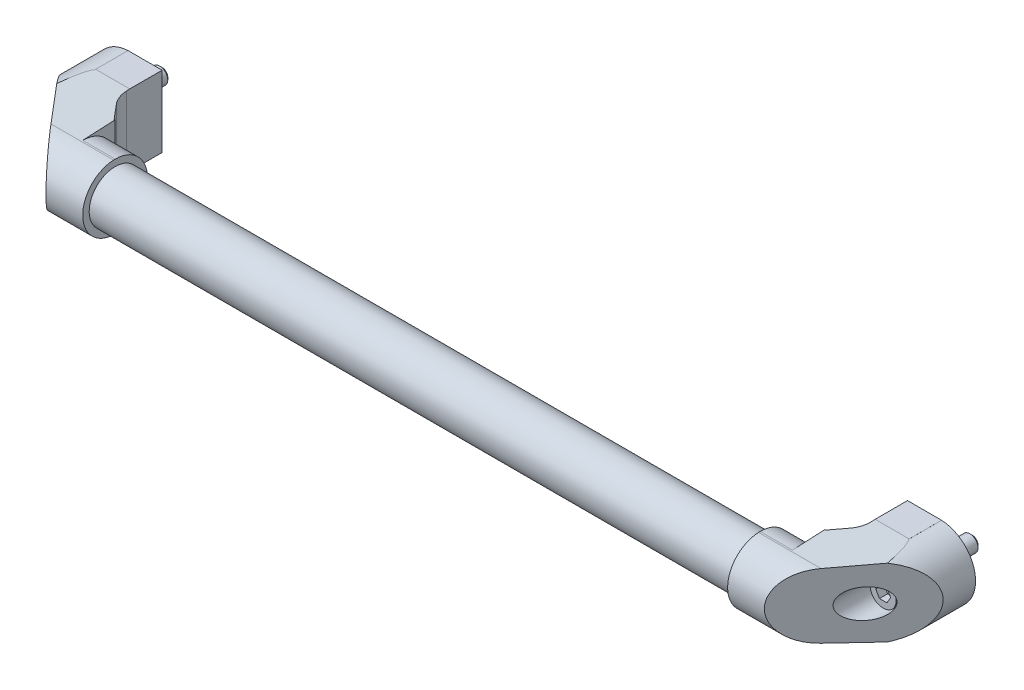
ISO-10303-21;
HEADER;
FILE_DESCRIPTION(('STEP AP214'),'2;1');
FILE_NAME('part.step','',(''),(''),'','','');
FILE_SCHEMA(('AUTOMOTIVE_DESIGN { 1 0 10303 214 1 1 1 1 }'));
ENDSEC;
DATA;
#1=APPLICATION_CONTEXT('core data for automotive mechanical design processes');
#2=APPLICATION_PROTOCOL_DEFINITION('international standard','automotive_design',2000,#1);
#3=PRODUCT_CONTEXT('',#1,'mechanical');
#4=PRODUCT('Part','Part','',(#3));
#5=PRODUCT_RELATED_PRODUCT_CATEGORY('part','',(#4));
#6=PRODUCT_DEFINITION_FORMATION('','',#4);
#7=PRODUCT_DEFINITION_CONTEXT('part definition',#1,'design');
#8=PRODUCT_DEFINITION('design','',#6,#7);
#9=PRODUCT_DEFINITION_SHAPE('','',#8);
#10=(LENGTH_UNIT() NAMED_UNIT(*) SI_UNIT(.MILLI.,.METRE.));
#11=(NAMED_UNIT(*) PLANE_ANGLE_UNIT() SI_UNIT($,.RADIAN.));
#12=(NAMED_UNIT(*) SI_UNIT($,.STERADIAN.) SOLID_ANGLE_UNIT());
#13=UNCERTAINTY_MEASURE_WITH_UNIT(LENGTH_MEASURE(1.E-05),#10,'distance_accuracy_value','');
#14=(GEOMETRIC_REPRESENTATION_CONTEXT(3) GLOBAL_UNCERTAINTY_ASSIGNED_CONTEXT((#13)) GLOBAL_UNIT_ASSIGNED_CONTEXT((#10,
#11,#12)) REPRESENTATION_CONTEXT('',''));
#15=CARTESIAN_POINT('',(0.,0.,0.));
#16=DIRECTION('',(0.,0.,1.));
#17=DIRECTION('',(1.,0.,0.));
#18=AXIS2_PLACEMENT_3D('',#15,#16,#17);
#19=CARTESIAN_POINT('',(0.,0.,25.));
#20=DIRECTION('',(0.,0.,1.));
#21=DIRECTION('',(1.,0.,0.));
#22=AXIS2_PLACEMENT_3D('',#19,#20,#21);
#23=PLANE('',#22);
#24=CARTESIAN_POINT('',(0.,0.,25.));
#25=DIRECTION('',(0.,0.,1.));
#26=DIRECTION('',(1.,0.,0.));
#27=AXIS2_PLACEMENT_3D('',#24,#25,#26);
#28=CIRCLE('',#27,9.);
#29=CARTESIAN_POINT('',(9.,0.,25.));
#30=VERTEX_POINT('',#29);
#31=EDGE_CURVE('E428',#30,#30,#28,.T.);
#32=ORIENTED_EDGE('',*,*,#31,.T.);
#33=EDGE_LOOP('',(#32));
#34=FACE_BOUND('',#33,.T.);
#35=CARTESIAN_POINT('',(0.,0.,25.));
#36=DIRECTION('',(0.,0.,1.));
#37=DIRECTION('',(1.,0.,0.));
#38=AXIS2_PLACEMENT_3D('',#35,#36,#37);
#39=CIRCLE('',#38,8.);
#40=CARTESIAN_POINT('',(8.,0.,25.));
#41=VERTEX_POINT('',#40);
#42=EDGE_CURVE('E404',#41,#41,#39,.T.);
#43=ORIENTED_EDGE('',*,*,#42,.F.);
#44=EDGE_LOOP('',(#43));
#45=FACE_BOUND('',#44,.T.);
#46=ADVANCED_FACE('F14',(#34,#45),#23,.T.);
#47=CARTESIAN_POINT('',(500.,0.,25.));
#48=DIRECTION('',(0.,0.,1.));
#49=DIRECTION('',(1.,0.,0.));
#50=AXIS2_PLACEMENT_3D('',#47,#48,#49);
#51=PLANE('',#50);
#52=CARTESIAN_POINT('',(500.,0.,25.));
#53=DIRECTION('',(0.,0.,1.));
#54=DIRECTION('',(1.,0.,0.));
#55=AXIS2_PLACEMENT_3D('',#52,#53,#54);
#56=CIRCLE('',#55,9.);
#57=CARTESIAN_POINT('',(509.,0.,25.));
#58=VERTEX_POINT('',#57);
#59=EDGE_CURVE('E423',#58,#58,#56,.T.);
#60=ORIENTED_EDGE('',*,*,#59,.T.);
#61=EDGE_LOOP('',(#60));
#62=FACE_BOUND('',#61,.T.);
#63=CARTESIAN_POINT('',(500.,0.,25.));
#64=DIRECTION('',(0.,0.,1.));
#65=DIRECTION('',(1.,0.,0.));
#66=AXIS2_PLACEMENT_3D('',#63,#64,#65);
#67=CIRCLE('',#66,8.);
#68=CARTESIAN_POINT('',(508.,0.,25.));
#69=VERTEX_POINT('',#68);
#70=EDGE_CURVE('E417',#69,#69,#67,.T.);
#71=ORIENTED_EDGE('',*,*,#70,.F.);
#72=EDGE_LOOP('',(#71));
#73=FACE_BOUND('',#72,.T.);
#74=ADVANCED_FACE('F808',(#62,#73),#51,.T.);
#75=CARTESIAN_POINT('',(522.,-19.9756503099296,60.9866076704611));
#76=DIRECTION('',(0.,0.998782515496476,-0.0493303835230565));
#77=DIRECTION('',(0.,0.0493303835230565,0.998782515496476));
#78=AXIS2_PLACEMENT_3D('',#75,#76,#77);
#79=PLANE('',#78);
#80=CARTESIAN_POINT('',(500.,0.,465.429647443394));
#81=DIRECTION('',(0.,0.998782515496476,-0.0493303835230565));
#82=DIRECTION('',(0.,-0.0493303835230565,-0.998782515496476));
#83=AXIS2_PLACEMENT_3D('',#80,#81,#82);
#84=ELLIPSE('',#83,445.972612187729,22.);
#85=CARTESIAN_POINT('',(506.307780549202,-21.0763351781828,38.7012589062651));
#86=VERTEX_POINT('',#85);
#87=CARTESIAN_POINT('',(500.99896854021,-21.9773078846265,20.4594427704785));
#88=VERTEX_POINT('',#87);
#89=EDGE_CURVE('E590',#86,#88,#84,.T.);
#90=ORIENTED_EDGE('',*,*,#89,.F.);
#91=DIRECTION('',(-0.642328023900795,0.0378082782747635,0.765496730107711));
#92=VECTOR('',#91,1.);
#93=CARTESIAN_POINT('',(501.797722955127,-20.8108672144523,44.076136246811));
#94=LINE('',#93,#92);
#95=CARTESIAN_POINT('',(487.608152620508,-19.9756503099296,60.9866076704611));
#96=VERTEX_POINT('',#95);
#97=EDGE_CURVE('E670',#86,#96,#94,.T.);
#98=ORIENTED_EDGE('',*,*,#97,.T.);
#99=DIRECTION('',(-1.,0.,0.));
#100=VECTOR('',#99,1.);
#101=CARTESIAN_POINT('',(522.,-19.9756503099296,60.9866076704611));
#102=LINE('',#101,#100);
#103=CARTESIAN_POINT('',(449.,-19.9756503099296,60.9866076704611));
#104=VERTEX_POINT('',#103);
#105=EDGE_CURVE('E692',#96,#104,#102,.T.);
#106=ORIENTED_EDGE('',*,*,#105,.T.);
#107=DIRECTION('',(0.,-0.0493303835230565,-0.998782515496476));
#108=VECTOR('',#107,1.);
#109=CARTESIAN_POINT('',(449.,-19.9756503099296,60.9866076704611));
#110=LINE('',#109,#108);
#111=CARTESIAN_POINT('',(449.,-20.0243793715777,60.));
#112=VERTEX_POINT('',#111);
#113=EDGE_CURVE('E676',#104,#112,#110,.T.);
#114=ORIENTED_EDGE('',*,*,#113,.T.);
#115=DIRECTION('',(-1.,0.,0.));
#116=VECTOR('',#115,1.);
#117=CARTESIAN_POINT('',(522.,-20.0243793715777,60.));
#118=LINE('',#117,#116);
#119=CARTESIAN_POINT('',(469.,-20.0243793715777,60.));
#120=VERTEX_POINT('',#119);
#121=EDGE_CURVE('E626',#120,#112,#118,.T.);
#122=ORIENTED_EDGE('',*,*,#121,.F.);
#123=DIRECTION('',(0.,0.0493303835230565,0.998782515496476));
#124=VECTOR('',#123,1.);
#125=CARTESIAN_POINT('',(469.,-19.9756503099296,60.9866076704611));
#126=LINE('',#125,#124);
#127=CARTESIAN_POINT('',(469.,-21.0121896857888,40.));
#128=VERTEX_POINT('',#127);
#129=EDGE_CURVE('E621',#128,#120,#126,.T.);
#130=ORIENTED_EDGE('',*,*,#129,.F.);
#131=DIRECTION('',(-1.,0.,0.));
#132=VECTOR('',#131,1.);
#133=CARTESIAN_POINT('',(522.,-21.0121896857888,40.));
#134=LINE('',#133,#132);
#135=CARTESIAN_POINT('',(469.581212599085,-21.0121896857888,40.));
#136=VERTEX_POINT('',#135);
#137=EDGE_CURVE('E652',#136,#128,#134,.T.);
#138=ORIENTED_EDGE('',*,*,#137,.F.);
#139=DIRECTION('',(0.642328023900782,-0.0378082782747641,-0.765496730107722));
#140=VECTOR('',#139,1.);
#141=CARTESIAN_POINT('',(480.864145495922,-21.6763180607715,26.5535241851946));
#142=LINE('',#141,#140);
#143=CARTESIAN_POINT('',(476.510146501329,-21.4200359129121,31.7424181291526));
#144=VERTEX_POINT('',#143);
#145=EDGE_CURVE('E662',#136,#144,#142,.T.);
#146=ORIENTED_EDGE('',*,*,#145,.T.);
#147=CARTESIAN_POINT('',(465.000018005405,-21.8951021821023,22.1238453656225));
#148=DIRECTION('',(0.,0.998782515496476,-0.0493303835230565));
#149=DIRECTION('',(0.,-0.0493303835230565,-0.998782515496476));
#150=AXIS2_PLACEMENT_3D('',#147,#148,#149);
#151=ELLIPSE('',#150,15.0182845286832,15.);
#152=CARTESIAN_POINT('',(480.,-21.8962500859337,22.1006039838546));
#153=VERTEX_POINT('',#152);
#154=EDGE_CURVE('E660',#153,#144,#151,.F.);
#155=ORIENTED_EDGE('',*,*,#154,.F.);
#156=DIRECTION('',(0.,0.0493303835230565,0.998782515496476));
#157=VECTOR('',#156,1.);
#158=CARTESIAN_POINT('',(480.,-19.9756503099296,60.9866076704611));
#159=LINE('',#158,#157);
#160=CARTESIAN_POINT('',(480.,-22.,20.));
#161=VERTEX_POINT('',#160);
#162=EDGE_CURVE('E658',#161,#153,#159,.T.);
#163=ORIENTED_EDGE('',*,*,#162,.F.);
#164=DIRECTION('',(-1.,0.,0.));
#165=VECTOR('',#164,1.);
#166=CARTESIAN_POINT('',(522.,-22.,20.));
#167=LINE('',#166,#165);
#168=CARTESIAN_POINT('',(500.99896854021,-22.,20.));
#169=VERTEX_POINT('',#168);
#170=EDGE_CURVE('E690',#169,#161,#167,.T.);
#171=ORIENTED_EDGE('',*,*,#170,.F.);
#172=DIRECTION('',(0.,-0.0493303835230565,-0.998782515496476));
#173=VECTOR('',#172,1.);
#174=CARTESIAN_POINT('',(500.99896854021,-19.9756503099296,60.9866076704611));
#175=LINE('',#174,#173);
#176=EDGE_CURVE('E595',#88,#169,#175,.T.);
#177=ORIENTED_EDGE('',*,*,#176,.F.);
#178=EDGE_LOOP('',(#90,#98,#106,#114,#122,#130,#138,#146,#155,#163,#171,#177));
#179=FACE_BOUND('',#178,.T.);
#180=ADVANCED_FACE('F16',(#179),#79,.F.);
#181=CARTESIAN_POINT('',(522.,-22.,0.));
#182=DIRECTION('',(0.,0.,1.));
#183=DIRECTION('',(1.,0.,0.));
#184=AXIS2_PLACEMENT_3D('',#181,#182,#183);
#185=PLANE('',#184);
#186=CARTESIAN_POINT('',(500.,0.,0.));
#187=DIRECTION('',(0.,0.,1.));
#188=DIRECTION('',(1.,0.,0.));
#189=AXIS2_PLACEMENT_3D('',#186,#187,#188);
#190=CIRCLE('',#189,4.99999999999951);
#191=CARTESIAN_POINT('',(505.,0.,0.));
#192=VERTEX_POINT('',#191);
#193=EDGE_CURVE('E704',#192,#192,#190,.F.);
#194=ORIENTED_EDGE('',*,*,#193,.F.);
#195=EDGE_LOOP('',(#194));
#196=FACE_BOUND('',#195,.T.);
#197=DIRECTION('',(-1.,0.,0.));
#198=VECTOR('',#197,1.);
#199=CARTESIAN_POINT('',(522.,22.,0.));
#200=LINE('',#199,#198);
#201=CARTESIAN_POINT('',(500.99896854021,22.,0.));
#202=VERTEX_POINT('',#201);
#203=CARTESIAN_POINT('',(480.,22.,0.));
#204=VERTEX_POINT('',#203);
#205=EDGE_CURVE('E686',#202,#204,#200,.T.);
#206=ORIENTED_EDGE('',*,*,#205,.F.);
#207=DIRECTION('',(0.,1.,0.));
#208=VECTOR('',#207,1.);
#209=CARTESIAN_POINT('',(500.99896854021,21.9773078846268,0.));
#210=LINE('',#209,#208);
#211=CARTESIAN_POINT('',(500.99896854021,21.9773078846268,0.));
#212=VERTEX_POINT('',#211);
#213=EDGE_CURVE('E576',#212,#202,#210,.T.);
#214=ORIENTED_EDGE('',*,*,#213,.F.);
#215=CARTESIAN_POINT('',(500.,0.,0.));
#216=DIRECTION('',(0.,0.,-1.));
#217=DIRECTION('',(-1.,0.,0.));
#218=AXIS2_PLACEMENT_3D('',#215,#216,#217);
#219=CIRCLE('',#218,22.);
#220=CARTESIAN_POINT('',(500.99896854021,-21.9773078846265,0.));
#221=VERTEX_POINT('',#220);
#222=EDGE_CURVE('E578',#212,#221,#219,.T.);
#223=ORIENTED_EDGE('',*,*,#222,.T.);
#224=DIRECTION('',(0.,-1.,0.));
#225=VECTOR('',#224,1.);
#226=CARTESIAN_POINT('',(500.99896854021,-21.9773078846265,0.));
#227=LINE('',#226,#225);
#228=CARTESIAN_POINT('',(500.99896854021,-22.,0.));
#229=VERTEX_POINT('',#228);
#230=EDGE_CURVE('E580',#221,#229,#227,.T.);
#231=ORIENTED_EDGE('',*,*,#230,.T.);
#232=DIRECTION('',(-1.,0.,0.));
#233=VECTOR('',#232,1.);
#234=CARTESIAN_POINT('',(522.,-22.,0.));
#235=LINE('',#234,#233);
#236=CARTESIAN_POINT('',(480.,-22.,0.));
#237=VERTEX_POINT('',#236);
#238=EDGE_CURVE('E688',#229,#237,#235,.T.);
#239=ORIENTED_EDGE('',*,*,#238,.T.);
#240=DIRECTION('',(0.,-1.,0.));
#241=VECTOR('',#240,1.);
#242=CARTESIAN_POINT('',(480.,22.,0.));
#243=LINE('',#242,#241);
#244=EDGE_CURVE('E638',#204,#237,#243,.T.);
#245=ORIENTED_EDGE('',*,*,#244,.F.);
#246=EDGE_LOOP('',(#206,#214,#223,#231,#239,#245));
#247=FACE_BOUND('',#246,.T.);
#248=ADVANCED_FACE('F732',(#196,#247),#185,.F.);
#249=CARTESIAN_POINT('',(522.,-22.,0.));
#250=DIRECTION('',(0.,-1.,0.));
#251=DIRECTION('',(1.,0.,0.));
#252=AXIS2_PLACEMENT_3D('',#249,#250,#251);
#253=PLANE('',#252);
#254=ORIENTED_EDGE('',*,*,#238,.F.);
#255=DIRECTION('',(0.,0.,1.));
#256=VECTOR('',#255,1.);
#257=CARTESIAN_POINT('',(500.99896854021,-22.,0.));
#258=LINE('',#257,#256);
#259=EDGE_CURVE('E9',#229,#169,#258,.T.);
#260=ORIENTED_EDGE('',*,*,#259,.T.);
#261=ORIENTED_EDGE('',*,*,#170,.T.);
#262=DIRECTION('',(0.,0.,-1.));
#263=VECTOR('',#262,1.);
#264=CARTESIAN_POINT('',(480.,-22.,0.));
#265=LINE('',#264,#263);
#266=EDGE_CURVE('E655',#161,#237,#265,.T.);
#267=ORIENTED_EDGE('',*,*,#266,.T.);
#268=EDGE_LOOP('',(#254,#260,#261,#267));
#269=FACE_BOUND('',#268,.T.);
#270=ADVANCED_FACE('F737',(#269),#253,.T.);
#271=CARTESIAN_POINT('',(522.,-22.,20.));
#272=DIRECTION('',(-0.766044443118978,0.,-0.64278760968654));
#273=DIRECTION('',(-0.64278760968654,0.,0.766044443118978));
#274=AXIS2_PLACEMENT_3D('',#271,#272,#273);
#275=PLANE('',#274);
#276=CARTESIAN_POINT('',(500.,0.,46.2185790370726));
#277=DIRECTION('',(-0.766044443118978,0.,-0.64278760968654));
#278=DIRECTION('',(-0.64278760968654,0.,0.766044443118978));
#279=AXIS2_PLACEMENT_3D('',#276,#277,#278);
#280=ELLIPSE('',#279,14.0015144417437,9.);
#281=CARTESIAN_POINT('',(491.,0.,56.9443613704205));
#282=VERTEX_POINT('',#281);
#283=EDGE_CURVE('E628',#282,#282,#280,.T.);
#284=ORIENTED_EDGE('',*,*,#283,.T.);
#285=EDGE_LOOP('',(#284));
#286=FACE_BOUND('',#285,.T.);
#287=ORIENTED_EDGE('',*,*,#97,.F.);
#288=CARTESIAN_POINT('',(500.,0.,46.2185790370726));
#289=DIRECTION('',(-0.766044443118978,0.,-0.64278760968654));
#290=DIRECTION('',(0.64278760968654,0.,-0.766044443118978));
#291=AXIS2_PLACEMENT_3D('',#288,#289,#290);
#292=ELLIPSE('',#291,34.225924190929,22.);
#293=CARTESIAN_POINT('',(506.307780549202,21.076335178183,38.7012589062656));
#294=VERTEX_POINT('',#293);
#295=EDGE_CURVE('E713',#294,#86,#292,.T.);
#296=ORIENTED_EDGE('',*,*,#295,.F.);
#297=DIRECTION('',(0.642328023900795,0.0378082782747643,-0.765496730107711));
#298=VECTOR('',#297,1.);
#299=CARTESIAN_POINT('',(522.,22.,20.));
#300=LINE('',#299,#298);
#301=CARTESIAN_POINT('',(487.608152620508,19.9756503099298,60.9866076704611));
#302=VERTEX_POINT('',#301);
#303=EDGE_CURVE('E665',#302,#294,#300,.T.);
#304=ORIENTED_EDGE('',*,*,#303,.F.);
#305=CARTESIAN_POINT('',(488.436014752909,0.,60.));
#306=DIRECTION('',(-0.766044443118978,0.,-0.64278760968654));
#307=DIRECTION('',(-0.64278760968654,0.,0.766044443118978));
#308=AXIS2_PLACEMENT_3D('',#305,#306,#307);
#309=ELLIPSE('',#308,26.1081457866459,20.);
#310=EDGE_CURVE('E668',#96,#302,#309,.T.);
#311=ORIENTED_EDGE('',*,*,#310,.F.);
#312=EDGE_LOOP('',(#287,#296,#304,#311));
#313=FACE_BOUND('',#312,.T.);
#314=ADVANCED_FACE('F787',(#286,#313),#275,.F.);
#315=CARTESIAN_POINT('',(449.,0.,60.));
#316=DIRECTION('',(1.,0.,0.));
#317=DIRECTION('',(0.,1.,0.));
#318=AXIS2_PLACEMENT_3D('',#315,#316,#317);
#319=PLANE('',#318);
#320=CARTESIAN_POINT('',(449.,0.,60.));
#321=DIRECTION('',(1.,0.,0.));
#322=DIRECTION('',(0.,1.,0.));
#323=AXIS2_PLACEMENT_3D('',#320,#321,#322);
#324=CIRCLE('',#323,16.);
#325=CARTESIAN_POINT('',(449.,16.,60.));
#326=VERTEX_POINT('',#325);
#327=EDGE_CURVE('E672',#326,#326,#324,.T.);
#328=ORIENTED_EDGE('',*,*,#327,.T.);
#329=EDGE_LOOP('',(#328));
#330=FACE_BOUND('',#329,.T.);
#331=DIRECTION('',(0.,-1.,0.));
#332=VECTOR('',#331,1.);
#333=CARTESIAN_POINT('',(449.,-20.,60.));
#334=LINE('',#333,#332);
#335=CARTESIAN_POINT('',(449.,-20.,60.));
#336=VERTEX_POINT('',#335);
#337=EDGE_CURVE('E599',#336,#112,#334,.T.);
#338=ORIENTED_EDGE('',*,*,#337,.T.);
#339=ORIENTED_EDGE('',*,*,#113,.F.);
#340=CARTESIAN_POINT('',(449.,0.,60.));
#341=DIRECTION('',(1.,0.,0.));
#342=DIRECTION('',(0.,1.,0.));
#343=AXIS2_PLACEMENT_3D('',#340,#341,#342);
#344=CIRCLE('',#343,20.);
#345=CARTESIAN_POINT('',(449.,19.9756503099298,60.9866076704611));
#346=VERTEX_POINT('',#345);
#347=EDGE_CURVE('E673',#346,#104,#344,.T.);
#348=ORIENTED_EDGE('',*,*,#347,.F.);
#349=DIRECTION('',(0.,-0.0493303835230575,0.998782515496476));
#350=VECTOR('',#349,1.);
#351=CARTESIAN_POINT('',(449.,22.,20.));
#352=LINE('',#351,#350);
#353=CARTESIAN_POINT('',(449.,20.0243793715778,60.));
#354=VERTEX_POINT('',#353);
#355=EDGE_CURVE('E679',#354,#346,#352,.T.);
#356=ORIENTED_EDGE('',*,*,#355,.F.);
#357=DIRECTION('',(0.,1.,0.));
#358=VECTOR('',#357,1.);
#359=CARTESIAN_POINT('',(449.,20.,60.));
#360=LINE('',#359,#358);
#361=CARTESIAN_POINT('',(449.,20.,60.));
#362=VERTEX_POINT('',#361);
#363=EDGE_CURVE('E602',#362,#354,#360,.T.);
#364=ORIENTED_EDGE('',*,*,#363,.F.);
#365=CARTESIAN_POINT('',(449.,0.,60.));
#366=DIRECTION('',(-1.,0.,0.));
#367=DIRECTION('',(0.,-1.,0.));
#368=AXIS2_PLACEMENT_3D('',#365,#366,#367);
#369=CIRCLE('',#368,20.);
#370=EDGE_CURVE('E597',#362,#336,#369,.T.);
#371=ORIENTED_EDGE('',*,*,#370,.T.);
#372=EDGE_LOOP('',(#338,#339,#348,#356,#364,#371));
#373=FACE_BOUND('',#372,.T.);
#374=ADVANCED_FACE('F777',(#330,#373),#319,.F.);
#375=CARTESIAN_POINT('',(449.,22.,40.));
#376=DIRECTION('',(0.,0.,-1.));
#377=DIRECTION('',(-1.,0.,0.));
#378=AXIS2_PLACEMENT_3D('',#375,#376,#377);
#379=PLANE('',#378);
#380=ORIENTED_EDGE('',*,*,#137,.T.);
#381=DIRECTION('',(0.,1.,0.));
#382=VECTOR('',#381,1.);
#383=CARTESIAN_POINT('',(469.,22.,40.));
#384=LINE('',#383,#382);
#385=CARTESIAN_POINT('',(469.,0.,40.));
#386=VERTEX_POINT('',#385);
#387=EDGE_CURVE('E712',#128,#386,#384,.T.);
#388=ORIENTED_EDGE('',*,*,#387,.T.);
#389=CARTESIAN_POINT('',(469.,21.012189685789,40.));
#390=VERTEX_POINT('',#389);
#391=EDGE_CURVE('E707',#386,#390,#384,.T.);
#392=ORIENTED_EDGE('',*,*,#391,.T.);
#393=DIRECTION('',(1.,0.,0.));
#394=VECTOR('',#393,1.);
#395=CARTESIAN_POINT('',(522.,21.012189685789,40.));
#396=LINE('',#395,#394);
#397=CARTESIAN_POINT('',(469.581212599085,21.012189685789,40.));
#398=VERTEX_POINT('',#397);
#399=EDGE_CURVE('E650',#390,#398,#396,.T.);
#400=ORIENTED_EDGE('',*,*,#399,.T.);
#401=DIRECTION('',(0.,-1.,0.));
#402=VECTOR('',#401,1.);
#403=CARTESIAN_POINT('',(469.581212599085,22.,40.));
#404=LINE('',#403,#402);
#405=EDGE_CURVE('E647',#398,#136,#404,.T.);
#406=ORIENTED_EDGE('',*,*,#405,.T.);
#407=EDGE_LOOP('',(#380,#388,#392,#400,#406));
#408=FACE_BOUND('',#407,.T.);
#409=ADVANCED_FACE('F755',(#408),#379,.T.);
#410=CARTESIAN_POINT('',(522.,22.,0.));
#411=DIRECTION('',(0.,-1.,0.));
#412=DIRECTION('',(1.,0.,0.));
#413=AXIS2_PLACEMENT_3D('',#410,#411,#412);
#414=PLANE('',#413);
#415=DIRECTION('',(-1.,0.,0.));
#416=VECTOR('',#415,1.);
#417=CARTESIAN_POINT('',(522.,22.,20.));
#418=LINE('',#417,#416);
#419=CARTESIAN_POINT('',(500.99896854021,22.,20.));
#420=VERTEX_POINT('',#419);
#421=CARTESIAN_POINT('',(480.,22.,20.));
#422=VERTEX_POINT('',#421);
#423=EDGE_CURVE('E684',#420,#422,#418,.T.);
#424=ORIENTED_EDGE('',*,*,#423,.F.);
#425=DIRECTION('',(0.,0.,-1.));
#426=VECTOR('',#425,1.);
#427=CARTESIAN_POINT('',(500.99896854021,22.,0.));
#428=LINE('',#427,#426);
#429=EDGE_CURVE('E592',#420,#202,#428,.T.);
#430=ORIENTED_EDGE('',*,*,#429,.T.);
#431=ORIENTED_EDGE('',*,*,#205,.T.);
#432=DIRECTION('',(0.,0.,-1.));
#433=VECTOR('',#432,1.);
#434=CARTESIAN_POINT('',(480.,22.,22.1006039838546));
#435=LINE('',#434,#433);
#436=EDGE_CURVE('E635',#422,#204,#435,.T.);
#437=ORIENTED_EDGE('',*,*,#436,.F.);
#438=EDGE_LOOP('',(#424,#430,#431,#437));
#439=FACE_BOUND('',#438,.T.);
#440=ADVANCED_FACE('F724',(#439),#414,.F.);
#441=CARTESIAN_POINT('',(522.,22.,20.));
#442=DIRECTION('',(0.,-0.998782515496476,-0.0493303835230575));
#443=DIRECTION('',(0.,0.0493303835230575,-0.998782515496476));
#444=AXIS2_PLACEMENT_3D('',#441,#442,#443);
#445=PLANE('',#444);
#446=CARTESIAN_POINT('',(500.,0.,465.429647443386));
#447=DIRECTION('',(0.,-0.998782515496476,-0.0493303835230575));
#448=DIRECTION('',(0.,0.0493303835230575,-0.998782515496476));
#449=AXIS2_PLACEMENT_3D('',#446,#447,#448);
#450=ELLIPSE('',#449,445.97261218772,22.);
#451=CARTESIAN_POINT('',(500.99896854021,21.9773078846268,20.4594427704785));
#452=VERTEX_POINT('',#451);
#453=EDGE_CURVE('E588',#452,#294,#450,.T.);
#454=ORIENTED_EDGE('',*,*,#453,.F.);
#455=DIRECTION('',(0.,0.0493303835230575,-0.998782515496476));
#456=VECTOR('',#455,1.);
#457=CARTESIAN_POINT('',(500.99896854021,22.,20.));
#458=LINE('',#457,#456);
#459=EDGE_CURVE('E22',#452,#420,#458,.T.);
#460=ORIENTED_EDGE('',*,*,#459,.T.);
#461=ORIENTED_EDGE('',*,*,#423,.T.);
#462=DIRECTION('',(0.,0.0493303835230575,-0.998782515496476));
#463=VECTOR('',#462,1.);
#464=CARTESIAN_POINT('',(480.,22.,20.));
#465=LINE('',#464,#463);
#466=CARTESIAN_POINT('',(480.,21.8962500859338,22.1006039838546));
#467=VERTEX_POINT('',#466);
#468=EDGE_CURVE('E694',#467,#422,#465,.T.);
#469=ORIENTED_EDGE('',*,*,#468,.F.);
#470=CARTESIAN_POINT('',(465.000018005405,21.8951021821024,22.1238453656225));
#471=DIRECTION('',(0.,-0.998782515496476,-0.0493303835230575));
#472=DIRECTION('',(0.,-0.0493303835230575,0.998782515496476));
#473=AXIS2_PLACEMENT_3D('',#470,#471,#472);
#474=ELLIPSE('',#473,15.0182845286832,15.);
#475=CARTESIAN_POINT('',(476.510146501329,21.4200359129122,31.7424181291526));
#476=VERTEX_POINT('',#475);
#477=EDGE_CURVE('E699',#476,#467,#474,.F.);
#478=ORIENTED_EDGE('',*,*,#477,.F.);
#479=DIRECTION('',(-0.642328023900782,-0.0378082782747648,0.765496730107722));
#480=VECTOR('',#479,1.);
#481=CARTESIAN_POINT('',(501.066422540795,22.8654508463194,2.47738793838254));
#482=LINE('',#481,#480);
#483=EDGE_CURVE('E701',#476,#398,#482,.T.);
#484=ORIENTED_EDGE('',*,*,#483,.T.);
#485=ORIENTED_EDGE('',*,*,#399,.F.);
#486=DIRECTION('',(0.,0.0493303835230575,-0.998782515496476));
#487=VECTOR('',#486,1.);
#488=CARTESIAN_POINT('',(469.,22.,20.));
#489=LINE('',#488,#487);
#490=CARTESIAN_POINT('',(469.,20.0243793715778,60.));
#491=VERTEX_POINT('',#490);
#492=EDGE_CURVE('E619',#491,#390,#489,.T.);
#493=ORIENTED_EDGE('',*,*,#492,.F.);
#494=DIRECTION('',(-1.,0.,0.));
#495=VECTOR('',#494,1.);
#496=CARTESIAN_POINT('',(522.,20.0243793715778,60.));
#497=LINE('',#496,#495);
#498=EDGE_CURVE('E623',#491,#354,#497,.T.);
#499=ORIENTED_EDGE('',*,*,#498,.T.);
#500=ORIENTED_EDGE('',*,*,#355,.T.);
#501=DIRECTION('',(-1.,0.,0.));
#502=VECTOR('',#501,1.);
#503=CARTESIAN_POINT('',(522.,19.9756503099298,60.9866076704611));
#504=LINE('',#503,#502);
#505=EDGE_CURVE('E681',#302,#346,#504,.T.);
#506=ORIENTED_EDGE('',*,*,#505,.F.);
#507=ORIENTED_EDGE('',*,*,#303,.T.);
#508=EDGE_LOOP('',(#454,#460,#461,#469,#478,#484,#485,#493,#499,#500,#506,#507));
#509=FACE_BOUND('',#508,.T.);
#510=ADVANCED_FACE('F718',(#509),#445,.F.);
#511=CARTESIAN_POINT('',(522.,0.,60.));
#512=DIRECTION('',(-1.,0.,0.));
#513=DIRECTION('',(0.,-1.,0.));
#514=AXIS2_PLACEMENT_3D('',#511,#512,#513);
#515=CYLINDRICAL_SURFACE('',#514,20.);
#516=ORIENTED_EDGE('',*,*,#310,.T.);
#517=ORIENTED_EDGE('',*,*,#505,.T.);
#518=ORIENTED_EDGE('',*,*,#347,.T.);
#519=ORIENTED_EDGE('',*,*,#105,.F.);
#520=EDGE_LOOP('',(#516,#517,#518,#519));
#521=FACE_BOUND('',#520,.T.);
#522=ADVANCED_FACE('F781',(#521),#515,.T.);
#523=CARTESIAN_POINT('',(491.182067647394,0.,60.));
#524=DIRECTION('',(1.,0.,0.));
#525=DIRECTION('',(0.,1.,0.));
#526=AXIS2_PLACEMENT_3D('',#523,#524,#525);
#527=CYLINDRICAL_SURFACE('',#526,16.);
#528=ORIENTED_EDGE('',*,*,#327,.F.);
#529=EDGE_LOOP('',(#528));
#530=FACE_BOUND('',#529,.T.);
#531=CARTESIAN_POINT('',(51.,0.,60.));
#532=DIRECTION('',(1.,0.,0.));
#533=DIRECTION('',(0.,1.,0.));
#534=AXIS2_PLACEMENT_3D('',#531,#532,#533);
#535=CIRCLE('',#534,16.);
#536=CARTESIAN_POINT('',(51.,16.,60.));
#537=VERTEX_POINT('',#536);
#538=EDGE_CURVE('E527',#537,#537,#535,.T.);
#539=ORIENTED_EDGE('',*,*,#538,.T.);
#540=EDGE_LOOP('',(#539));
#541=FACE_BOUND('',#540,.T.);
#542=ADVANCED_FACE('F1251',(#530,#541),#527,.T.);
#543=CARTESIAN_POINT('',(476.510146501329,22.,31.7424181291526));
#544=DIRECTION('',(0.766044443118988,0.,0.642787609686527));
#545=DIRECTION('',(0.642787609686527,0.,-0.766044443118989));
#546=AXIS2_PLACEMENT_3D('',#543,#544,#545);
#547=PLANE('',#546);
#548=ORIENTED_EDGE('',*,*,#405,.F.);
#549=ORIENTED_EDGE('',*,*,#483,.F.);
#550=DIRECTION('',(0.,-1.,0.));
#551=VECTOR('',#550,1.);
#552=CARTESIAN_POINT('',(476.510146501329,22.,31.7424181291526));
#553=LINE('',#552,#551);
#554=EDGE_CURVE('E644',#476,#144,#553,.T.);
#555=ORIENTED_EDGE('',*,*,#554,.T.);
#556=ORIENTED_EDGE('',*,*,#145,.F.);
#557=EDGE_LOOP('',(#548,#549,#555,#556));
#558=FACE_BOUND('',#557,.T.);
#559=ADVANCED_FACE('F751',(#558),#547,.F.);
#560=CARTESIAN_POINT('',(465.000018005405,22.,22.1238453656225));
#561=DIRECTION('',(0.,-1.,0.));
#562=DIRECTION('',(1.,0.,0.));
#563=AXIS2_PLACEMENT_3D('',#560,#561,#562);
#564=CYLINDRICAL_SURFACE('',#563,15.);
#565=ORIENTED_EDGE('',*,*,#154,.T.);
#566=ORIENTED_EDGE('',*,*,#554,.F.);
#567=ORIENTED_EDGE('',*,*,#477,.T.);
#568=DIRECTION('',(0.,-1.,0.));
#569=VECTOR('',#568,1.);
#570=CARTESIAN_POINT('',(480.,22.,22.1006039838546));
#571=LINE('',#570,#569);
#572=EDGE_CURVE('E641',#467,#153,#571,.T.);
#573=ORIENTED_EDGE('',*,*,#572,.T.);
#574=EDGE_LOOP('',(#565,#566,#567,#573));
#575=FACE_BOUND('',#574,.T.);
#576=ADVANCED_FACE('F747',(#575),#564,.F.);
#577=CARTESIAN_POINT('',(480.,22.,22.1006039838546));
#578=DIRECTION('',(-1.,0.,0.));
#579=DIRECTION('',(0.,-1.,0.));
#580=AXIS2_PLACEMENT_3D('',#577,#578,#579);
#581=PLANE('',#580);
#582=ORIENTED_EDGE('',*,*,#162,.T.);
#583=ORIENTED_EDGE('',*,*,#572,.F.);
#584=ORIENTED_EDGE('',*,*,#468,.T.);
#585=ORIENTED_EDGE('',*,*,#436,.T.);
#586=ORIENTED_EDGE('',*,*,#244,.T.);
#587=ORIENTED_EDGE('',*,*,#266,.F.);
#588=EDGE_LOOP('',(#582,#583,#584,#585,#586,#587));
#589=FACE_BOUND('',#588,.T.);
#590=ADVANCED_FACE('F728',(#589),#581,.T.);
#591=CARTESIAN_POINT('',(500.,0.,31.7424181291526));
#592=DIRECTION('',(0.,0.,1.));
#593=DIRECTION('',(0.,-1.,0.));
#594=AXIS2_PLACEMENT_3D('',#591,#592,#593);
#595=CYLINDRICAL_SURFACE('',#594,4.99999999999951);
#596=CARTESIAN_POINT('',(500.,0.,-18.5));
#597=DIRECTION('',(0.,0.,1.));
#598=DIRECTION('',(0.,-1.,0.));
#599=AXIS2_PLACEMENT_3D('',#596,#597,#598);
#600=CIRCLE('',#599,4.99999999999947);
#601=CARTESIAN_POINT('',(500.,-4.99999999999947,-18.5));
#602=VERTEX_POINT('',#601);
#603=EDGE_CURVE('E629',#602,#602,#600,.T.);
#604=ORIENTED_EDGE('',*,*,#603,.T.);
#605=EDGE_LOOP('',(#604));
#606=FACE_BOUND('',#605,.T.);
#607=ORIENTED_EDGE('',*,*,#193,.T.);
#608=EDGE_LOOP('',(#607));
#609=FACE_BOUND('',#608,.T.);
#610=ADVANCED_FACE('F1204',(#606,#609),#595,.T.);
#611=CARTESIAN_POINT('',(500.,0.,-20.));
#612=DIRECTION('',(0.,0.,1.));
#613=DIRECTION('',(0.,-1.,0.));
#614=AXIS2_PLACEMENT_3D('',#611,#612,#613);
#615=PLANE('',#614);
#616=CARTESIAN_POINT('',(500.,0.,-20.));
#617=DIRECTION('',(0.,0.,1.));
#618=DIRECTION('',(0.,-1.,0.));
#619=AXIS2_PLACEMENT_3D('',#616,#617,#618);
#620=CIRCLE('',#619,3.49999999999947);
#621=CARTESIAN_POINT('',(500.,-3.49999999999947,-20.));
#622=VERTEX_POINT('',#621);
#623=EDGE_CURVE('E632',#622,#622,#620,.T.);
#624=ORIENTED_EDGE('',*,*,#623,.F.);
#625=EDGE_LOOP('',(#624));
#626=FACE_BOUND('',#625,.T.);
#627=ADVANCED_FACE('F1209',(#626),#615,.F.);
#628=CARTESIAN_POINT('',(500.,0.,-20.));
#629=DIRECTION('',(0.,0.,1.));
#630=DIRECTION('',(0.,-1.,0.));
#631=AXIS2_PLACEMENT_3D('',#628,#629,#630);
#632=CONICAL_SURFACE('',#631,3.49999999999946,0.785398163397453);
#633=ORIENTED_EDGE('',*,*,#603,.F.);
#634=EDGE_LOOP('',(#633));
#635=FACE_BOUND('',#634,.T.);
#636=ORIENTED_EDGE('',*,*,#623,.T.);
#637=EDGE_LOOP('',(#636));
#638=FACE_BOUND('',#637,.T.);
#639=ADVANCED_FACE('F1156',(#635,#638),#632,.T.);
#640=CARTESIAN_POINT('',(500.,0.,30.));
#641=DIRECTION('',(0.,0.,1.));
#642=DIRECTION('',(1.,0.,0.));
#643=AXIS2_PLACEMENT_3D('',#640,#641,#642);
#644=CYLINDRICAL_SURFACE('',#643,9.);
#645=ORIENTED_EDGE('',*,*,#283,.F.);
#646=EDGE_LOOP('',(#645));
#647=FACE_BOUND('',#646,.T.);
#648=ORIENTED_EDGE('',*,*,#59,.F.);
#649=EDGE_LOOP('',(#648));
#650=FACE_BOUND('',#649,.T.);
#651=ADVANCED_FACE('F1150',(#647,#650),#644,.F.);
#652=CARTESIAN_POINT('',(469.,-20.,60.));
#653=DIRECTION('',(0.,0.,-1.));
#654=DIRECTION('',(-1.,0.,0.));
#655=AXIS2_PLACEMENT_3D('',#652,#653,#654);
#656=PLANE('',#655);
#657=ORIENTED_EDGE('',*,*,#121,.T.);
#658=ORIENTED_EDGE('',*,*,#337,.F.);
#659=DIRECTION('',(-1.,0.,0.));
#660=VECTOR('',#659,1.);
#661=CARTESIAN_POINT('',(469.,-20.,60.));
#662=LINE('',#661,#660);
#663=CARTESIAN_POINT('',(469.,-20.,60.));
#664=VERTEX_POINT('',#663);
#665=EDGE_CURVE('E616',#664,#336,#662,.T.);
#666=ORIENTED_EDGE('',*,*,#665,.F.);
#667=DIRECTION('',(0.,-1.,0.));
#668=VECTOR('',#667,1.);
#669=CARTESIAN_POINT('',(469.,-20.,60.));
#670=LINE('',#669,#668);
#671=EDGE_CURVE('E608',#664,#120,#670,.T.);
#672=ORIENTED_EDGE('',*,*,#671,.T.);
#673=EDGE_LOOP('',(#657,#658,#666,#672));
#674=FACE_BOUND('',#673,.T.);
#675=ADVANCED_FACE('F1155',(#674),#656,.T.);
#676=CARTESIAN_POINT('',(469.,20.,60.));
#677=DIRECTION('',(0.,0.,1.));
#678=DIRECTION('',(1.,0.,0.));
#679=AXIS2_PLACEMENT_3D('',#676,#677,#678);
#680=PLANE('',#679);
#681=DIRECTION('',(0.,1.,0.));
#682=VECTOR('',#681,1.);
#683=CARTESIAN_POINT('',(469.,20.,60.));
#684=LINE('',#683,#682);
#685=CARTESIAN_POINT('',(469.,20.,60.));
#686=VERTEX_POINT('',#685);
#687=EDGE_CURVE('E611',#686,#491,#684,.T.);
#688=ORIENTED_EDGE('',*,*,#687,.F.);
#689=DIRECTION('',(-1.,0.,0.));
#690=VECTOR('',#689,1.);
#691=CARTESIAN_POINT('',(469.,20.,60.));
#692=LINE('',#691,#690);
#693=EDGE_CURVE('E614',#686,#362,#692,.T.);
#694=ORIENTED_EDGE('',*,*,#693,.T.);
#695=ORIENTED_EDGE('',*,*,#363,.T.);
#696=ORIENTED_EDGE('',*,*,#498,.F.);
#697=EDGE_LOOP('',(#688,#694,#695,#696));
#698=FACE_BOUND('',#697,.T.);
#699=ADVANCED_FACE('F772',(#698),#680,.F.);
#700=CARTESIAN_POINT('',(469.,0.,60.));
#701=DIRECTION('',(-1.,0.,0.));
#702=DIRECTION('',(0.,-1.,0.));
#703=AXIS2_PLACEMENT_3D('',#700,#701,#702);
#704=CYLINDRICAL_SURFACE('',#703,20.);
#705=CARTESIAN_POINT('',(469.,0.,60.));
#706=DIRECTION('',(-1.,0.,0.));
#707=DIRECTION('',(0.,-1.,0.));
#708=AXIS2_PLACEMENT_3D('',#705,#706,#707);
#709=CIRCLE('',#708,20.);
#710=EDGE_CURVE('E605',#686,#386,#709,.T.);
#711=ORIENTED_EDGE('',*,*,#710,.T.);
#712=EDGE_CURVE('E604',#386,#664,#709,.T.);
#713=ORIENTED_EDGE('',*,*,#712,.T.);
#714=ORIENTED_EDGE('',*,*,#665,.T.);
#715=ORIENTED_EDGE('',*,*,#370,.F.);
#716=ORIENTED_EDGE('',*,*,#693,.F.);
#717=EDGE_LOOP('',(#711,#713,#714,#715,#716));
#718=FACE_BOUND('',#717,.T.);
#719=ADVANCED_FACE('F768',(#718),#704,.T.);
#720=CARTESIAN_POINT('',(469.,0.,60.));
#721=DIRECTION('',(-1.,0.,0.));
#722=DIRECTION('',(0.,-1.,0.));
#723=AXIS2_PLACEMENT_3D('',#720,#721,#722);
#724=PLANE('',#723);
#725=ORIENTED_EDGE('',*,*,#129,.T.);
#726=ORIENTED_EDGE('',*,*,#671,.F.);
#727=ORIENTED_EDGE('',*,*,#712,.F.);
#728=ORIENTED_EDGE('',*,*,#387,.F.);
#729=EDGE_LOOP('',(#725,#726,#727,#728));
#730=FACE_BOUND('',#729,.T.);
#731=ADVANCED_FACE('F764',(#730),#724,.T.);
#732=ORIENTED_EDGE('',*,*,#492,.T.);
#733=ORIENTED_EDGE('',*,*,#391,.F.);
#734=ORIENTED_EDGE('',*,*,#710,.F.);
#735=ORIENTED_EDGE('',*,*,#687,.T.);
#736=EDGE_LOOP('',(#732,#733,#734,#735));
#737=FACE_BOUND('',#736,.T.);
#738=ADVANCED_FACE('F760',(#737),#724,.T.);
#739=CARTESIAN_POINT('',(500.99896854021,-21.9773078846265,80.));
#740=DIRECTION('',(1.,0.,0.));
#741=DIRECTION('',(0.,1.,0.));
#742=AXIS2_PLACEMENT_3D('',#739,#740,#741);
#743=PLANE('',#742);
#744=ORIENTED_EDGE('',*,*,#176,.T.);
#745=ORIENTED_EDGE('',*,*,#259,.F.);
#746=ORIENTED_EDGE('',*,*,#230,.F.);
#747=DIRECTION('',(0.,0.,-1.));
#748=VECTOR('',#747,1.);
#749=CARTESIAN_POINT('',(500.99896854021,-21.9773078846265,80.));
#750=LINE('',#749,#748);
#751=EDGE_CURVE('E583',#88,#221,#750,.T.);
#752=ORIENTED_EDGE('',*,*,#751,.F.);
#753=EDGE_LOOP('',(#744,#745,#746,#752));
#754=FACE_BOUND('',#753,.T.);
#755=ADVANCED_FACE('F792',(#754),#743,.T.);
#756=CARTESIAN_POINT('',(500.99896854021,21.9773078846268,80.));
#757=DIRECTION('',(-1.,0.,0.));
#758=DIRECTION('',(0.,-1.,0.));
#759=AXIS2_PLACEMENT_3D('',#756,#757,#758);
#760=PLANE('',#759);
#761=ORIENTED_EDGE('',*,*,#459,.F.);
#762=DIRECTION('',(0.,0.,-1.));
#763=VECTOR('',#762,1.);
#764=CARTESIAN_POINT('',(500.99896854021,21.9773078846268,80.));
#765=LINE('',#764,#763);
#766=EDGE_CURVE('E586',#452,#212,#765,.T.);
#767=ORIENTED_EDGE('',*,*,#766,.T.);
#768=ORIENTED_EDGE('',*,*,#213,.T.);
#769=ORIENTED_EDGE('',*,*,#429,.F.);
#770=EDGE_LOOP('',(#761,#767,#768,#769));
#771=FACE_BOUND('',#770,.T.);
#772=ADVANCED_FACE('F794',(#771),#760,.F.);
#773=CARTESIAN_POINT('',(500.,0.,80.));
#774=DIRECTION('',(0.,0.,-1.));
#775=DIRECTION('',(-1.,0.,0.));
#776=AXIS2_PLACEMENT_3D('',#773,#774,#775);
#777=CYLINDRICAL_SURFACE('',#776,22.);
#778=ORIENTED_EDGE('',*,*,#295,.T.);
#779=ORIENTED_EDGE('',*,*,#89,.T.);
#780=ORIENTED_EDGE('',*,*,#751,.T.);
#781=ORIENTED_EDGE('',*,*,#222,.F.);
#782=ORIENTED_EDGE('',*,*,#766,.F.);
#783=ORIENTED_EDGE('',*,*,#453,.T.);
#784=EDGE_LOOP('',(#778,#779,#780,#781,#782,#783));
#785=FACE_BOUND('',#784,.T.);
#786=ADVANCED_FACE('F789',(#785),#777,.T.);
#787=CARTESIAN_POINT('',(-22.,-19.9756503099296,60.9866076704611));
#788=DIRECTION('',(0.,0.998782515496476,-0.0493303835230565));
#789=DIRECTION('',(0.,0.0493303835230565,0.998782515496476));
#790=AXIS2_PLACEMENT_3D('',#787,#788,#789);
#791=PLANE('',#790);
#792=CARTESIAN_POINT('',(0.,0.,465.429647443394));
#793=DIRECTION('',(0.,-0.998782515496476,0.0493303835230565));
#794=DIRECTION('',(0.,-0.0493303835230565,-0.998782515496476));
#795=AXIS2_PLACEMENT_3D('',#792,#793,#794);
#796=ELLIPSE('',#795,445.972612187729,22.);
#797=CARTESIAN_POINT('',(-6.307780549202,-21.0763351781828,38.7012589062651));
#798=VERTEX_POINT('',#797);
#799=CARTESIAN_POINT('',(-0.998968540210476,-21.9773078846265,20.4594427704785));
#800=VERTEX_POINT('',#799);
#801=EDGE_CURVE('E445',#798,#800,#796,.T.);
#802=ORIENTED_EDGE('',*,*,#801,.T.);
#803=DIRECTION('',(0.,-0.0493303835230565,-0.998782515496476));
#804=VECTOR('',#803,1.);
#805=CARTESIAN_POINT('',(-0.998968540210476,-19.9756503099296,60.9866076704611));
#806=LINE('',#805,#804);
#807=CARTESIAN_POINT('',(-0.998968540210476,-22.,20.));
#808=VERTEX_POINT('',#807);
#809=EDGE_CURVE('E450',#800,#808,#806,.T.);
#810=ORIENTED_EDGE('',*,*,#809,.T.);
#811=DIRECTION('',(1.,0.,0.));
#812=VECTOR('',#811,1.);
#813=CARTESIAN_POINT('',(-22.,-22.,20.));
#814=LINE('',#813,#812);
#815=CARTESIAN_POINT('',(20.,-22.,20.));
#816=VERTEX_POINT('',#815);
#817=EDGE_CURVE('E545',#808,#816,#814,.T.);
#818=ORIENTED_EDGE('',*,*,#817,.T.);
#819=DIRECTION('',(0.,0.0493303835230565,0.998782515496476));
#820=VECTOR('',#819,1.);
#821=CARTESIAN_POINT('',(20.,-19.9756503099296,60.9866076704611));
#822=LINE('',#821,#820);
#823=CARTESIAN_POINT('',(20.,-21.8962500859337,22.1006039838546));
#824=VERTEX_POINT('',#823);
#825=EDGE_CURVE('E513',#816,#824,#822,.T.);
#826=ORIENTED_EDGE('',*,*,#825,.T.);
#827=CARTESIAN_POINT('',(34.999981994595,-21.8951021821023,22.1238453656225));
#828=DIRECTION('',(0.,-0.998782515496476,0.0493303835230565));
#829=DIRECTION('',(0.,-0.0493303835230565,-0.998782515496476));
#830=AXIS2_PLACEMENT_3D('',#827,#828,#829);
#831=ELLIPSE('',#830,15.0182845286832,15.);
#832=CARTESIAN_POINT('',(23.4898534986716,-21.4200359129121,31.7424181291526));
#833=VERTEX_POINT('',#832);
#834=EDGE_CURVE('E515',#824,#833,#831,.F.);
#835=ORIENTED_EDGE('',*,*,#834,.T.);
#836=DIRECTION('',(-0.642328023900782,-0.0378082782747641,-0.765496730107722));
#837=VECTOR('',#836,1.);
#838=CARTESIAN_POINT('',(19.135854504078,-21.6763180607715,26.5535241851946));
#839=LINE('',#838,#837);
#840=CARTESIAN_POINT('',(30.4187874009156,-21.0121896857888,40.));
#841=VERTEX_POINT('',#840);
#842=EDGE_CURVE('E517',#841,#833,#839,.T.);
#843=ORIENTED_EDGE('',*,*,#842,.F.);
#844=DIRECTION('',(1.,0.,0.));
#845=VECTOR('',#844,1.);
#846=CARTESIAN_POINT('',(-22.,-21.0121896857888,40.));
#847=LINE('',#846,#845);
#848=CARTESIAN_POINT('',(31.,-21.0121896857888,40.));
#849=VERTEX_POINT('',#848);
#850=EDGE_CURVE('E507',#841,#849,#847,.T.);
#851=ORIENTED_EDGE('',*,*,#850,.T.);
#852=DIRECTION('',(0.,0.0493303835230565,0.998782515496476));
#853=VECTOR('',#852,1.);
#854=CARTESIAN_POINT('',(31.,-19.9756503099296,60.9866076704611));
#855=LINE('',#854,#853);
#856=CARTESIAN_POINT('',(31.,-20.0243793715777,60.));
#857=VERTEX_POINT('',#856);
#858=EDGE_CURVE('E476',#849,#857,#855,.T.);
#859=ORIENTED_EDGE('',*,*,#858,.T.);
#860=DIRECTION('',(1.,0.,0.));
#861=VECTOR('',#860,1.);
#862=CARTESIAN_POINT('',(-22.,-20.0243793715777,60.));
#863=LINE('',#862,#861);
#864=CARTESIAN_POINT('',(51.,-20.0243793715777,60.));
#865=VERTEX_POINT('',#864);
#866=EDGE_CURVE('E481',#857,#865,#863,.T.);
#867=ORIENTED_EDGE('',*,*,#866,.T.);
#868=DIRECTION('',(0.,-0.0493303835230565,-0.998782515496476));
#869=VECTOR('',#868,1.);
#870=CARTESIAN_POINT('',(51.,-19.9756503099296,60.9866076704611));
#871=LINE('',#870,#869);
#872=CARTESIAN_POINT('',(51.,-19.9756503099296,60.9866076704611));
#873=VERTEX_POINT('',#872);
#874=EDGE_CURVE('E531',#873,#865,#871,.T.);
#875=ORIENTED_EDGE('',*,*,#874,.F.);
#876=DIRECTION('',(1.,0.,0.));
#877=VECTOR('',#876,1.);
#878=CARTESIAN_POINT('',(-22.,-19.9756503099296,60.9866076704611));
#879=LINE('',#878,#877);
#880=CARTESIAN_POINT('',(12.391847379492,-19.9756503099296,60.9866076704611));
#881=VERTEX_POINT('',#880);
#882=EDGE_CURVE('E547',#881,#873,#879,.T.);
#883=ORIENTED_EDGE('',*,*,#882,.F.);
#884=DIRECTION('',(0.642328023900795,0.0378082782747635,0.765496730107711));
#885=VECTOR('',#884,1.);
#886=CARTESIAN_POINT('',(-1.79772295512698,-20.8108672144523,44.076136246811));
#887=LINE('',#886,#885);
#888=EDGE_CURVE('E525',#798,#881,#887,.T.);
#889=ORIENTED_EDGE('',*,*,#888,.F.);
#890=EDGE_LOOP('',(#802,#810,#818,#826,#835,#843,#851,#859,#867,#875,#883,#889));
#891=FACE_BOUND('',#890,.T.);
#892=ADVANCED_FACE('F803',(#891),#791,.F.);
#893=CARTESIAN_POINT('',(-22.,-22.,0.));
#894=DIRECTION('',(0.,0.,1.));
#895=DIRECTION('',(-1.,0.,0.));
#896=AXIS2_PLACEMENT_3D('',#893,#894,#895);
#897=PLANE('',#896);
#898=CARTESIAN_POINT('',(0.,0.,0.));
#899=DIRECTION('',(0.,0.,-1.));
#900=DIRECTION('',(-1.,0.,0.));
#901=AXIS2_PLACEMENT_3D('',#898,#899,#900);
#902=CIRCLE('',#901,4.99999999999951);
#903=CARTESIAN_POINT('',(-4.99999999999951,0.,0.));
#904=VERTEX_POINT('',#903);
#905=EDGE_CURVE('E559',#904,#904,#902,.F.);
#906=ORIENTED_EDGE('',*,*,#905,.T.);
#907=EDGE_LOOP('',(#906));
#908=FACE_BOUND('',#907,.T.);
#909=DIRECTION('',(1.,0.,0.));
#910=VECTOR('',#909,1.);
#911=CARTESIAN_POINT('',(-22.,22.,0.));
#912=LINE('',#911,#910);
#913=CARTESIAN_POINT('',(-0.998968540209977,22.,0.));
#914=VERTEX_POINT('',#913);
#915=CARTESIAN_POINT('',(20.,22.,0.));
#916=VERTEX_POINT('',#915);
#917=EDGE_CURVE('E541',#914,#916,#912,.T.);
#918=ORIENTED_EDGE('',*,*,#917,.T.);
#919=DIRECTION('',(0.,-1.,0.));
#920=VECTOR('',#919,1.);
#921=CARTESIAN_POINT('',(20.,22.,0.));
#922=LINE('',#921,#920);
#923=CARTESIAN_POINT('',(20.,-22.,0.));
#924=VERTEX_POINT('',#923);
#925=EDGE_CURVE('E493',#916,#924,#922,.T.);
#926=ORIENTED_EDGE('',*,*,#925,.T.);
#927=DIRECTION('',(1.,0.,0.));
#928=VECTOR('',#927,1.);
#929=CARTESIAN_POINT('',(-22.,-22.,0.));
#930=LINE('',#929,#928);
#931=CARTESIAN_POINT('',(-0.998968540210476,-22.,0.));
#932=VERTEX_POINT('',#931);
#933=EDGE_CURVE('E543',#932,#924,#930,.T.);
#934=ORIENTED_EDGE('',*,*,#933,.F.);
#935=DIRECTION('',(0.,-1.,0.));
#936=VECTOR('',#935,1.);
#937=CARTESIAN_POINT('',(-0.998968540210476,-21.9773078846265,0.));
#938=LINE('',#937,#936);
#939=CARTESIAN_POINT('',(-0.998968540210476,-21.9773078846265,0.));
#940=VERTEX_POINT('',#939);
#941=EDGE_CURVE('E435',#940,#932,#938,.T.);
#942=ORIENTED_EDGE('',*,*,#941,.F.);
#943=CARTESIAN_POINT('',(0.,0.,0.));
#944=DIRECTION('',(0.,0.,1.));
#945=DIRECTION('',(1.,0.,0.));
#946=AXIS2_PLACEMENT_3D('',#943,#944,#945);
#947=CIRCLE('',#946,22.);
#948=CARTESIAN_POINT('',(-0.998968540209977,21.9773078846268,0.));
#949=VERTEX_POINT('',#948);
#950=EDGE_CURVE('E433',#949,#940,#947,.T.);
#951=ORIENTED_EDGE('',*,*,#950,.F.);
#952=DIRECTION('',(0.,1.,0.));
#953=VECTOR('',#952,1.);
#954=CARTESIAN_POINT('',(-0.998968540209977,21.9773078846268,0.));
#955=LINE('',#954,#953);
#956=EDGE_CURVE('E431',#949,#914,#955,.T.);
#957=ORIENTED_EDGE('',*,*,#956,.T.);
#958=EDGE_LOOP('',(#918,#926,#934,#942,#951,#957));
#959=FACE_BOUND('',#958,.T.);
#960=ADVANCED_FACE('F903',(#908,#959),#897,.F.);
#961=CARTESIAN_POINT('',(-22.,-22.,0.));
#962=DIRECTION('',(0.,-1.,0.));
#963=DIRECTION('',(-1.,0.,0.));
#964=AXIS2_PLACEMENT_3D('',#961,#962,#963);
#965=PLANE('',#964);
#966=ORIENTED_EDGE('',*,*,#933,.T.);
#967=DIRECTION('',(0.,0.,-1.));
#968=VECTOR('',#967,1.);
#969=CARTESIAN_POINT('',(20.,-22.,0.));
#970=LINE('',#969,#968);
#971=EDGE_CURVE('E510',#816,#924,#970,.T.);
#972=ORIENTED_EDGE('',*,*,#971,.F.);
#973=ORIENTED_EDGE('',*,*,#817,.F.);
#974=DIRECTION('',(0.,0.,1.));
#975=VECTOR('',#974,1.);
#976=CARTESIAN_POINT('',(-0.998968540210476,-22.,0.));
#977=LINE('',#976,#975);
#978=EDGE_CURVE('E573',#932,#808,#977,.T.);
#979=ORIENTED_EDGE('',*,*,#978,.F.);
#980=EDGE_LOOP('',(#966,#972,#973,#979));
#981=FACE_BOUND('',#980,.T.);
#982=ADVANCED_FACE('F888',(#981),#965,.T.);
#983=CARTESIAN_POINT('',(-22.,-22.,20.));
#984=DIRECTION('',(0.766044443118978,0.,-0.64278760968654));
#985=DIRECTION('',(0.64278760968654,0.,0.766044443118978));
#986=AXIS2_PLACEMENT_3D('',#983,#984,#985);
#987=PLANE('',#986);
#988=CARTESIAN_POINT('',(0.,0.,46.2185790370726));
#989=DIRECTION('',(-0.766044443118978,0.,0.64278760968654));
#990=DIRECTION('',(0.64278760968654,0.,0.766044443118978));
#991=AXIS2_PLACEMENT_3D('',#988,#989,#990);
#992=ELLIPSE('',#991,14.0015144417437,9.);
#993=CARTESIAN_POINT('',(9.,0.,56.9443613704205));
#994=VERTEX_POINT('',#993);
#995=EDGE_CURVE('E483',#994,#994,#992,.T.);
#996=ORIENTED_EDGE('',*,*,#995,.F.);
#997=EDGE_LOOP('',(#996));
#998=FACE_BOUND('',#997,.T.);
#999=ORIENTED_EDGE('',*,*,#888,.T.);
#1000=CARTESIAN_POINT('',(11.5639852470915,0.,60.));
#1001=DIRECTION('',(-0.766044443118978,0.,0.64278760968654));
#1002=DIRECTION('',(0.64278760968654,0.,0.766044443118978));
#1003=AXIS2_PLACEMENT_3D('',#1000,#1001,#1002);
#1004=ELLIPSE('',#1003,26.1081457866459,20.);
#1005=CARTESIAN_POINT('',(12.391847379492,19.9756503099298,60.9866076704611));
#1006=VERTEX_POINT('',#1005);
#1007=EDGE_CURVE('E523',#881,#1006,#1004,.T.);
#1008=ORIENTED_EDGE('',*,*,#1007,.T.);
#1009=DIRECTION('',(-0.642328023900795,0.0378082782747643,-0.765496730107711));
#1010=VECTOR('',#1009,1.);
#1011=CARTESIAN_POINT('',(-22.,22.,20.));
#1012=LINE('',#1011,#1010);
#1013=CARTESIAN_POINT('',(-6.307780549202,21.076335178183,38.7012589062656));
#1014=VERTEX_POINT('',#1013);
#1015=EDGE_CURVE('E520',#1006,#1014,#1012,.T.);
#1016=ORIENTED_EDGE('',*,*,#1015,.T.);
#1017=CARTESIAN_POINT('',(0.,0.,46.2185790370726));
#1018=DIRECTION('',(-0.766044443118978,0.,0.64278760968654));
#1019=DIRECTION('',(-0.64278760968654,0.,-0.766044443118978));
#1020=AXIS2_PLACEMENT_3D('',#1017,#1018,#1019);
#1021=ELLIPSE('',#1020,34.225924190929,22.);
#1022=EDGE_CURVE('E568',#1014,#798,#1021,.T.);
#1023=ORIENTED_EDGE('',*,*,#1022,.T.);
#1024=EDGE_LOOP('',(#999,#1008,#1016,#1023));
#1025=FACE_BOUND('',#1024,.T.);
#1026=ADVANCED_FACE('F885',(#998,#1025),#987,.F.);
#1027=CARTESIAN_POINT('',(51.,0.,60.));
#1028=DIRECTION('',(-1.,0.,0.));
#1029=DIRECTION('',(0.,1.,0.));
#1030=AXIS2_PLACEMENT_3D('',#1027,#1028,#1029);
#1031=PLANE('',#1030);
#1032=ORIENTED_EDGE('',*,*,#538,.F.);
#1033=EDGE_LOOP('',(#1032));
#1034=FACE_BOUND('',#1033,.T.);
#1035=DIRECTION('',(0.,-1.,0.));
#1036=VECTOR('',#1035,1.);
#1037=CARTESIAN_POINT('',(51.,-20.,60.));
#1038=LINE('',#1037,#1036);
#1039=CARTESIAN_POINT('',(51.,-20.,60.));
#1040=VERTEX_POINT('',#1039);
#1041=EDGE_CURVE('E454',#1040,#865,#1038,.T.);
#1042=ORIENTED_EDGE('',*,*,#1041,.F.);
#1043=CARTESIAN_POINT('',(51.,0.,60.));
#1044=DIRECTION('',(-1.,0.,0.));
#1045=DIRECTION('',(0.,-1.,0.));
#1046=AXIS2_PLACEMENT_3D('',#1043,#1044,#1045);
#1047=CIRCLE('',#1046,20.);
#1048=CARTESIAN_POINT('',(51.,20.,60.));
#1049=VERTEX_POINT('',#1048);
#1050=EDGE_CURVE('E452',#1049,#1040,#1047,.T.);
#1051=ORIENTED_EDGE('',*,*,#1050,.F.);
#1052=DIRECTION('',(0.,1.,0.));
#1053=VECTOR('',#1052,1.);
#1054=CARTESIAN_POINT('',(51.,20.,60.));
#1055=LINE('',#1054,#1053);
#1056=CARTESIAN_POINT('',(51.,20.0243793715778,60.));
#1057=VERTEX_POINT('',#1056);
#1058=EDGE_CURVE('E457',#1049,#1057,#1055,.T.);
#1059=ORIENTED_EDGE('',*,*,#1058,.T.);
#1060=DIRECTION('',(0.,-0.0493303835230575,0.998782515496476));
#1061=VECTOR('',#1060,1.);
#1062=CARTESIAN_POINT('',(51.,22.,20.));
#1063=LINE('',#1062,#1061);
#1064=CARTESIAN_POINT('',(51.,19.9756503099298,60.9866076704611));
#1065=VERTEX_POINT('',#1064);
#1066=EDGE_CURVE('E534',#1057,#1065,#1063,.T.);
#1067=ORIENTED_EDGE('',*,*,#1066,.T.);
#1068=CARTESIAN_POINT('',(51.,0.,60.));
#1069=DIRECTION('',(1.,0.,0.));
#1070=DIRECTION('',(0.,1.,0.));
#1071=AXIS2_PLACEMENT_3D('',#1068,#1069,#1070);
#1072=CIRCLE('',#1071,20.);
#1073=EDGE_CURVE('E528',#1065,#873,#1072,.T.);
#1074=ORIENTED_EDGE('',*,*,#1073,.T.);
#1075=ORIENTED_EDGE('',*,*,#874,.T.);
#1076=EDGE_LOOP('',(#1042,#1051,#1059,#1067,#1074,#1075));
#1077=FACE_BOUND('',#1076,.T.);
#1078=ADVANCED_FACE('F883',(#1034,#1077),#1031,.F.);
#1079=CARTESIAN_POINT('',(51.,22.,40.));
#1080=DIRECTION('',(0.,0.,-1.));
#1081=DIRECTION('',(1.,0.,0.));
#1082=AXIS2_PLACEMENT_3D('',#1079,#1080,#1081);
#1083=PLANE('',#1082);
#1084=ORIENTED_EDGE('',*,*,#850,.F.);
#1085=DIRECTION('',(0.,-1.,0.));
#1086=VECTOR('',#1085,1.);
#1087=CARTESIAN_POINT('',(30.4187874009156,22.,40.));
#1088=LINE('',#1087,#1086);
#1089=CARTESIAN_POINT('',(30.4187874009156,21.012189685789,40.));
#1090=VERTEX_POINT('',#1089);
#1091=EDGE_CURVE('E502',#1090,#841,#1088,.T.);
#1092=ORIENTED_EDGE('',*,*,#1091,.F.);
#1093=DIRECTION('',(-1.,0.,0.));
#1094=VECTOR('',#1093,1.);
#1095=CARTESIAN_POINT('',(-22.,21.012189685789,40.));
#1096=LINE('',#1095,#1094);
#1097=CARTESIAN_POINT('',(31.,21.012189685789,40.));
#1098=VERTEX_POINT('',#1097);
#1099=EDGE_CURVE('E505',#1098,#1090,#1096,.T.);
#1100=ORIENTED_EDGE('',*,*,#1099,.F.);
#1101=DIRECTION('',(0.,1.,0.));
#1102=VECTOR('',#1101,1.);
#1103=CARTESIAN_POINT('',(31.,22.,40.));
#1104=LINE('',#1103,#1102);
#1105=CARTESIAN_POINT('',(31.,0.,40.));
#1106=VERTEX_POINT('',#1105);
#1107=EDGE_CURVE('E562',#1106,#1098,#1104,.T.);
#1108=ORIENTED_EDGE('',*,*,#1107,.F.);
#1109=EDGE_CURVE('E567',#849,#1106,#1104,.T.);
#1110=ORIENTED_EDGE('',*,*,#1109,.F.);
#1111=EDGE_LOOP('',(#1084,#1092,#1100,#1108,#1110));
#1112=FACE_BOUND('',#1111,.T.);
#1113=ADVANCED_FACE('F879',(#1112),#1083,.T.);
#1114=CARTESIAN_POINT('',(-22.,22.,0.));
#1115=DIRECTION('',(0.,-1.,0.));
#1116=DIRECTION('',(-1.,0.,0.));
#1117=AXIS2_PLACEMENT_3D('',#1114,#1115,#1116);
#1118=PLANE('',#1117);
#1119=DIRECTION('',(1.,0.,0.));
#1120=VECTOR('',#1119,1.);
#1121=CARTESIAN_POINT('',(-22.,22.,20.));
#1122=LINE('',#1121,#1120);
#1123=CARTESIAN_POINT('',(-0.998968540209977,22.,20.));
#1124=VERTEX_POINT('',#1123);
#1125=CARTESIAN_POINT('',(20.,22.,20.));
#1126=VERTEX_POINT('',#1125);
#1127=EDGE_CURVE('E539',#1124,#1126,#1122,.T.);
#1128=ORIENTED_EDGE('',*,*,#1127,.T.);
#1129=DIRECTION('',(0.,0.,-1.));
#1130=VECTOR('',#1129,1.);
#1131=CARTESIAN_POINT('',(20.,22.,22.1006039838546));
#1132=LINE('',#1131,#1130);
#1133=EDGE_CURVE('E490',#1126,#916,#1132,.T.);
#1134=ORIENTED_EDGE('',*,*,#1133,.T.);
#1135=ORIENTED_EDGE('',*,*,#917,.F.);
#1136=DIRECTION('',(0.,0.,-1.));
#1137=VECTOR('',#1136,1.);
#1138=CARTESIAN_POINT('',(-0.998968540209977,22.,0.));
#1139=LINE('',#1138,#1137);
#1140=EDGE_CURVE('E447',#1124,#914,#1139,.T.);
#1141=ORIENTED_EDGE('',*,*,#1140,.F.);
#1142=EDGE_LOOP('',(#1128,#1134,#1135,#1141));
#1143=FACE_BOUND('',#1142,.T.);
#1144=ADVANCED_FACE('F882',(#1143),#1118,.F.);
#1145=CARTESIAN_POINT('',(-22.,22.,20.));
#1146=DIRECTION('',(0.,-0.998782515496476,-0.0493303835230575));
#1147=DIRECTION('',(0.,0.0493303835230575,-0.998782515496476));
#1148=AXIS2_PLACEMENT_3D('',#1145,#1146,#1147);
#1149=PLANE('',#1148);
#1150=CARTESIAN_POINT('',(0.,0.,465.429647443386));
#1151=DIRECTION('',(0.,0.998782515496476,0.0493303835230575));
#1152=DIRECTION('',(0.,0.0493303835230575,-0.998782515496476));
#1153=AXIS2_PLACEMENT_3D('',#1150,#1151,#1152);
#1154=ELLIPSE('',#1153,445.97261218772,22.);
#1155=CARTESIAN_POINT('',(-0.998968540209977,21.9773078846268,20.4594427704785));
#1156=VERTEX_POINT('',#1155);
#1157=EDGE_CURVE('E443',#1156,#1014,#1154,.T.);
#1158=ORIENTED_EDGE('',*,*,#1157,.T.);
#1159=ORIENTED_EDGE('',*,*,#1015,.F.);
#1160=DIRECTION('',(1.,0.,0.));
#1161=VECTOR('',#1160,1.);
#1162=CARTESIAN_POINT('',(-22.,19.9756503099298,60.9866076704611));
#1163=LINE('',#1162,#1161);
#1164=EDGE_CURVE('E536',#1006,#1065,#1163,.T.);
#1165=ORIENTED_EDGE('',*,*,#1164,.T.);
#1166=ORIENTED_EDGE('',*,*,#1066,.F.);
#1167=DIRECTION('',(1.,0.,0.));
#1168=VECTOR('',#1167,1.);
#1169=CARTESIAN_POINT('',(-22.,20.0243793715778,60.));
#1170=LINE('',#1169,#1168);
#1171=CARTESIAN_POINT('',(31.,20.0243793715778,60.));
#1172=VERTEX_POINT('',#1171);
#1173=EDGE_CURVE('E478',#1172,#1057,#1170,.T.);
#1174=ORIENTED_EDGE('',*,*,#1173,.F.);
#1175=DIRECTION('',(0.,0.0493303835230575,-0.998782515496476));
#1176=VECTOR('',#1175,1.);
#1177=CARTESIAN_POINT('',(31.,22.,20.));
#1178=LINE('',#1177,#1176);
#1179=EDGE_CURVE('E474',#1172,#1098,#1178,.T.);
#1180=ORIENTED_EDGE('',*,*,#1179,.T.);
#1181=ORIENTED_EDGE('',*,*,#1099,.T.);
#1182=DIRECTION('',(0.642328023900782,-0.0378082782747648,0.765496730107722));
#1183=VECTOR('',#1182,1.);
#1184=CARTESIAN_POINT('',(-1.06642254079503,22.8654508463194,2.47738793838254));
#1185=LINE('',#1184,#1183);
#1186=CARTESIAN_POINT('',(23.4898534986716,21.4200359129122,31.7424181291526));
#1187=VERTEX_POINT('',#1186);
#1188=EDGE_CURVE('E556',#1187,#1090,#1185,.T.);
#1189=ORIENTED_EDGE('',*,*,#1188,.F.);
#1190=CARTESIAN_POINT('',(34.999981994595,21.8951021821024,22.1238453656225));
#1191=DIRECTION('',(0.,0.998782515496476,0.0493303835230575));
#1192=DIRECTION('',(0.,-0.0493303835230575,0.998782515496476));
#1193=AXIS2_PLACEMENT_3D('',#1190,#1191,#1192);
#1194=ELLIPSE('',#1193,15.0182845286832,15.);
#1195=CARTESIAN_POINT('',(20.,21.8962500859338,22.1006039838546));
#1196=VERTEX_POINT('',#1195);
#1197=EDGE_CURVE('E554',#1187,#1196,#1194,.F.);
#1198=ORIENTED_EDGE('',*,*,#1197,.T.);
#1199=DIRECTION('',(0.,0.0493303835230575,-0.998782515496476));
#1200=VECTOR('',#1199,1.);
#1201=CARTESIAN_POINT('',(20.,22.,20.));
#1202=LINE('',#1201,#1200);
#1203=EDGE_CURVE('E549',#1196,#1126,#1202,.T.);
#1204=ORIENTED_EDGE('',*,*,#1203,.T.);
#1205=ORIENTED_EDGE('',*,*,#1127,.F.);
#1206=DIRECTION('',(0.,0.0493303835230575,-0.998782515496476));
#1207=VECTOR('',#1206,1.);
#1208=CARTESIAN_POINT('',(-0.998968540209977,22.,20.));
#1209=LINE('',#1208,#1207);
#1210=EDGE_CURVE('E570',#1156,#1124,#1209,.T.);
#1211=ORIENTED_EDGE('',*,*,#1210,.F.);
#1212=EDGE_LOOP('',(#1158,#1159,#1165,#1166,#1174,#1180,#1181,#1189,#1198,#1204,#1205,#1211));
#1213=FACE_BOUND('',#1212,.T.);
#1214=ADVANCED_FACE('F895',(#1213),#1149,.F.);
#1215=CARTESIAN_POINT('',(-22.,0.,60.));
#1216=DIRECTION('',(1.,0.,0.));
#1217=DIRECTION('',(0.,-1.,0.));
#1218=AXIS2_PLACEMENT_3D('',#1215,#1216,#1217);
#1219=CYLINDRICAL_SURFACE('',#1218,20.);
#1220=ORIENTED_EDGE('',*,*,#1007,.F.);
#1221=ORIENTED_EDGE('',*,*,#882,.T.);
#1222=ORIENTED_EDGE('',*,*,#1073,.F.);
#1223=ORIENTED_EDGE('',*,*,#1164,.F.);
#1224=EDGE_LOOP('',(#1220,#1221,#1222,#1223));
#1225=FACE_BOUND('',#1224,.T.);
#1226=ADVANCED_FACE('F877',(#1225),#1219,.T.);
#1227=CARTESIAN_POINT('',(23.4898534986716,22.,31.7424181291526));
#1228=DIRECTION('',(-0.766044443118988,0.,0.642787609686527));
#1229=DIRECTION('',(-0.642787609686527,0.,-0.766044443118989));
#1230=AXIS2_PLACEMENT_3D('',#1227,#1228,#1229);
#1231=PLANE('',#1230);
#1232=ORIENTED_EDGE('',*,*,#1091,.T.);
#1233=ORIENTED_EDGE('',*,*,#842,.T.);
#1234=DIRECTION('',(0.,-1.,0.));
#1235=VECTOR('',#1234,1.);
#1236=CARTESIAN_POINT('',(23.4898534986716,22.,31.7424181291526));
#1237=LINE('',#1236,#1235);
#1238=EDGE_CURVE('E499',#1187,#833,#1237,.T.);
#1239=ORIENTED_EDGE('',*,*,#1238,.F.);
#1240=ORIENTED_EDGE('',*,*,#1188,.T.);
#1241=EDGE_LOOP('',(#1232,#1233,#1239,#1240));
#1242=FACE_BOUND('',#1241,.T.);
#1243=ADVANCED_FACE('F873',(#1242),#1231,.F.);
#1244=CARTESIAN_POINT('',(34.999981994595,22.,22.1238453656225));
#1245=DIRECTION('',(0.,-1.,0.));
#1246=DIRECTION('',(-1.,0.,0.));
#1247=AXIS2_PLACEMENT_3D('',#1244,#1245,#1246);
#1248=CYLINDRICAL_SURFACE('',#1247,15.);
#1249=ORIENTED_EDGE('',*,*,#834,.F.);
#1250=DIRECTION('',(0.,-1.,0.));
#1251=VECTOR('',#1250,1.);
#1252=CARTESIAN_POINT('',(20.,22.,22.1006039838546));
#1253=LINE('',#1252,#1251);
#1254=EDGE_CURVE('E496',#1196,#824,#1253,.T.);
#1255=ORIENTED_EDGE('',*,*,#1254,.F.);
#1256=ORIENTED_EDGE('',*,*,#1197,.F.);
#1257=ORIENTED_EDGE('',*,*,#1238,.T.);
#1258=EDGE_LOOP('',(#1249,#1255,#1256,#1257));
#1259=FACE_BOUND('',#1258,.T.);
#1260=ADVANCED_FACE('F869',(#1259),#1248,.F.);
#1261=CARTESIAN_POINT('',(20.,22.,22.1006039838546));
#1262=DIRECTION('',(1.,0.,0.));
#1263=DIRECTION('',(0.,-1.,0.));
#1264=AXIS2_PLACEMENT_3D('',#1261,#1262,#1263);
#1265=PLANE('',#1264);
#1266=ORIENTED_EDGE('',*,*,#825,.F.);
#1267=ORIENTED_EDGE('',*,*,#971,.T.);
#1268=ORIENTED_EDGE('',*,*,#925,.F.);
#1269=ORIENTED_EDGE('',*,*,#1133,.F.);
#1270=ORIENTED_EDGE('',*,*,#1203,.F.);
#1271=ORIENTED_EDGE('',*,*,#1254,.T.);
#1272=EDGE_LOOP('',(#1266,#1267,#1268,#1269,#1270,#1271));
#1273=FACE_BOUND('',#1272,.T.);
#1274=ADVANCED_FACE('F859',(#1273),#1265,.T.);
#1275=CARTESIAN_POINT('',(0.,0.,31.7424181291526));
#1276=DIRECTION('',(0.,0.,1.));
#1277=DIRECTION('',(0.,-1.,0.));
#1278=AXIS2_PLACEMENT_3D('',#1275,#1276,#1277);
#1279=CYLINDRICAL_SURFACE('',#1278,4.99999999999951);
#1280=CARTESIAN_POINT('',(0.,0.,-18.5));
#1281=DIRECTION('',(0.,0.,-1.));
#1282=DIRECTION('',(0.,-1.,0.));
#1283=AXIS2_PLACEMENT_3D('',#1280,#1281,#1282);
#1284=CIRCLE('',#1283,4.99999999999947);
#1285=CARTESIAN_POINT('',(0.,-4.99999999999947,-18.5));
#1286=VERTEX_POINT('',#1285);
#1287=EDGE_CURVE('E484',#1286,#1286,#1284,.T.);
#1288=ORIENTED_EDGE('',*,*,#1287,.F.);
#1289=EDGE_LOOP('',(#1288));
#1290=FACE_BOUND('',#1289,.T.);
#1291=ORIENTED_EDGE('',*,*,#905,.F.);
#1292=EDGE_LOOP('',(#1291));
#1293=FACE_BOUND('',#1292,.T.);
#1294=ADVANCED_FACE('F855',(#1290,#1293),#1279,.T.);
#1295=CARTESIAN_POINT('',(0.,0.,-20.));
#1296=DIRECTION('',(0.,0.,1.));
#1297=DIRECTION('',(0.,-1.,0.));
#1298=AXIS2_PLACEMENT_3D('',#1295,#1296,#1297);
#1299=PLANE('',#1298);
#1300=CARTESIAN_POINT('',(0.,0.,-20.));
#1301=DIRECTION('',(0.,0.,-1.));
#1302=DIRECTION('',(0.,-1.,0.));
#1303=AXIS2_PLACEMENT_3D('',#1300,#1301,#1302);
#1304=CIRCLE('',#1303,3.49999999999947);
#1305=CARTESIAN_POINT('',(0.,-3.49999999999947,-20.));
#1306=VERTEX_POINT('',#1305);
#1307=EDGE_CURVE('E487',#1306,#1306,#1304,.T.);
#1308=ORIENTED_EDGE('',*,*,#1307,.T.);
#1309=EDGE_LOOP('',(#1308));
#1310=FACE_BOUND('',#1309,.T.);
#1311=ADVANCED_FACE('F858',(#1310),#1299,.F.);
#1312=CARTESIAN_POINT('',(0.,0.,-20.));
#1313=DIRECTION('',(0.,0.,1.));
#1314=DIRECTION('',(0.,-1.,0.));
#1315=AXIS2_PLACEMENT_3D('',#1312,#1313,#1314);
#1316=CONICAL_SURFACE('',#1315,3.49999999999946,0.785398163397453);
#1317=ORIENTED_EDGE('',*,*,#1287,.T.);
#1318=EDGE_LOOP('',(#1317));
#1319=FACE_BOUND('',#1318,.T.);
#1320=ORIENTED_EDGE('',*,*,#1307,.F.);
#1321=EDGE_LOOP('',(#1320));
#1322=FACE_BOUND('',#1321,.T.);
#1323=ADVANCED_FACE('F853',(#1319,#1322),#1316,.T.);
#1324=CARTESIAN_POINT('',(0.,0.,30.));
#1325=DIRECTION('',(0.,0.,1.));
#1326=DIRECTION('',(-1.,0.,0.));
#1327=AXIS2_PLACEMENT_3D('',#1324,#1325,#1326);
#1328=CYLINDRICAL_SURFACE('',#1327,9.);
#1329=ORIENTED_EDGE('',*,*,#995,.T.);
#1330=EDGE_LOOP('',(#1329));
#1331=FACE_BOUND('',#1330,.T.);
#1332=ORIENTED_EDGE('',*,*,#31,.F.);
#1333=EDGE_LOOP('',(#1332));
#1334=FACE_BOUND('',#1333,.T.);
#1335=ADVANCED_FACE('F849',(#1331,#1334),#1328,.F.);
#1336=CARTESIAN_POINT('',(31.,-20.,60.));
#1337=DIRECTION('',(0.,0.,-1.));
#1338=DIRECTION('',(1.,0.,0.));
#1339=AXIS2_PLACEMENT_3D('',#1336,#1337,#1338);
#1340=PLANE('',#1339);
#1341=ORIENTED_EDGE('',*,*,#866,.F.);
#1342=DIRECTION('',(0.,-1.,0.));
#1343=VECTOR('',#1342,1.);
#1344=CARTESIAN_POINT('',(31.,-20.,60.));
#1345=LINE('',#1344,#1343);
#1346=CARTESIAN_POINT('',(31.,-20.,60.));
#1347=VERTEX_POINT('',#1346);
#1348=EDGE_CURVE('E463',#1347,#857,#1345,.T.);
#1349=ORIENTED_EDGE('',*,*,#1348,.F.);
#1350=DIRECTION('',(1.,0.,0.));
#1351=VECTOR('',#1350,1.);
#1352=CARTESIAN_POINT('',(31.,-20.,60.));
#1353=LINE('',#1352,#1351);
#1354=EDGE_CURVE('E471',#1347,#1040,#1353,.T.);
#1355=ORIENTED_EDGE('',*,*,#1354,.T.);
#1356=ORIENTED_EDGE('',*,*,#1041,.T.);
#1357=EDGE_LOOP('',(#1341,#1349,#1355,#1356));
#1358=FACE_BOUND('',#1357,.T.);
#1359=ADVANCED_FACE('F845',(#1358),#1340,.T.);
#1360=CARTESIAN_POINT('',(31.,20.,60.));
#1361=DIRECTION('',(0.,0.,1.));
#1362=DIRECTION('',(-1.,0.,0.));
#1363=AXIS2_PLACEMENT_3D('',#1360,#1361,#1362);
#1364=PLANE('',#1363);
#1365=DIRECTION('',(0.,1.,0.));
#1366=VECTOR('',#1365,1.);
#1367=CARTESIAN_POINT('',(31.,20.,60.));
#1368=LINE('',#1367,#1366);
#1369=CARTESIAN_POINT('',(31.,20.,60.));
#1370=VERTEX_POINT('',#1369);
#1371=EDGE_CURVE('E466',#1370,#1172,#1368,.T.);
#1372=ORIENTED_EDGE('',*,*,#1371,.T.);
#1373=ORIENTED_EDGE('',*,*,#1173,.T.);
#1374=ORIENTED_EDGE('',*,*,#1058,.F.);
#1375=DIRECTION('',(1.,0.,0.));
#1376=VECTOR('',#1375,1.);
#1377=CARTESIAN_POINT('',(31.,20.,60.));
#1378=LINE('',#1377,#1376);
#1379=EDGE_CURVE('E469',#1370,#1049,#1378,.T.);
#1380=ORIENTED_EDGE('',*,*,#1379,.F.);
#1381=EDGE_LOOP('',(#1372,#1373,#1374,#1380));
#1382=FACE_BOUND('',#1381,.T.);
#1383=ADVANCED_FACE('F841',(#1382),#1364,.F.);
#1384=CARTESIAN_POINT('',(31.,0.,60.));
#1385=DIRECTION('',(1.,0.,0.));
#1386=DIRECTION('',(0.,-1.,0.));
#1387=AXIS2_PLACEMENT_3D('',#1384,#1385,#1386);
#1388=CYLINDRICAL_SURFACE('',#1387,20.);
#1389=CARTESIAN_POINT('',(31.,0.,60.));
#1390=DIRECTION('',(-1.,0.,0.));
#1391=DIRECTION('',(0.,-1.,0.));
#1392=AXIS2_PLACEMENT_3D('',#1389,#1390,#1391);
#1393=CIRCLE('',#1392,20.);
#1394=EDGE_CURVE('E460',#1370,#1106,#1393,.T.);
#1395=ORIENTED_EDGE('',*,*,#1394,.F.);
#1396=ORIENTED_EDGE('',*,*,#1379,.T.);
#1397=ORIENTED_EDGE('',*,*,#1050,.T.);
#1398=ORIENTED_EDGE('',*,*,#1354,.F.);
#1399=EDGE_CURVE('E459',#1106,#1347,#1393,.T.);
#1400=ORIENTED_EDGE('',*,*,#1399,.F.);
#1401=EDGE_LOOP('',(#1395,#1396,#1397,#1398,#1400));
#1402=FACE_BOUND('',#1401,.T.);
#1403=ADVANCED_FACE('F837',(#1402),#1388,.T.);
#1404=CARTESIAN_POINT('',(31.,0.,60.));
#1405=DIRECTION('',(1.,0.,0.));
#1406=DIRECTION('',(0.,-1.,0.));
#1407=AXIS2_PLACEMENT_3D('',#1404,#1405,#1406);
#1408=PLANE('',#1407);
#1409=ORIENTED_EDGE('',*,*,#858,.F.);
#1410=ORIENTED_EDGE('',*,*,#1109,.T.);
#1411=ORIENTED_EDGE('',*,*,#1399,.T.);
#1412=ORIENTED_EDGE('',*,*,#1348,.T.);
#1413=EDGE_LOOP('',(#1409,#1410,#1411,#1412));
#1414=FACE_BOUND('',#1413,.T.);
#1415=ADVANCED_FACE('F834',(#1414),#1408,.T.);
#1416=ORIENTED_EDGE('',*,*,#1179,.F.);
#1417=ORIENTED_EDGE('',*,*,#1371,.F.);
#1418=ORIENTED_EDGE('',*,*,#1394,.T.);
#1419=ORIENTED_EDGE('',*,*,#1107,.T.);
#1420=EDGE_LOOP('',(#1416,#1417,#1418,#1419));
#1421=FACE_BOUND('',#1420,.T.);
#1422=ADVANCED_FACE('F824',(#1421),#1408,.T.);
#1423=CARTESIAN_POINT('',(-0.998968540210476,-21.9773078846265,80.));
#1424=DIRECTION('',(-1.,0.,0.));
#1425=DIRECTION('',(0.,1.,0.));
#1426=AXIS2_PLACEMENT_3D('',#1423,#1424,#1425);
#1427=PLANE('',#1426);
#1428=ORIENTED_EDGE('',*,*,#809,.F.);
#1429=DIRECTION('',(0.,0.,-1.));
#1430=VECTOR('',#1429,1.);
#1431=CARTESIAN_POINT('',(-0.998968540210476,-21.9773078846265,80.));
#1432=LINE('',#1431,#1430);
#1433=EDGE_CURVE('E438',#800,#940,#1432,.T.);
#1434=ORIENTED_EDGE('',*,*,#1433,.T.);
#1435=ORIENTED_EDGE('',*,*,#941,.T.);
#1436=ORIENTED_EDGE('',*,*,#978,.T.);
#1437=EDGE_LOOP('',(#1428,#1434,#1435,#1436));
#1438=FACE_BOUND('',#1437,.T.);
#1439=ADVANCED_FACE('F820',(#1438),#1427,.T.);
#1440=CARTESIAN_POINT('',(-0.998968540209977,21.9773078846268,80.));
#1441=DIRECTION('',(1.,0.,0.));
#1442=DIRECTION('',(0.,-1.,0.));
#1443=AXIS2_PLACEMENT_3D('',#1440,#1441,#1442);
#1444=PLANE('',#1443);
#1445=ORIENTED_EDGE('',*,*,#1210,.T.);
#1446=ORIENTED_EDGE('',*,*,#1140,.T.);
#1447=ORIENTED_EDGE('',*,*,#956,.F.);
#1448=DIRECTION('',(0.,0.,-1.));
#1449=VECTOR('',#1448,1.);
#1450=CARTESIAN_POINT('',(-0.998968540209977,21.9773078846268,80.));
#1451=LINE('',#1450,#1449);
#1452=EDGE_CURVE('E441',#1156,#949,#1451,.T.);
#1453=ORIENTED_EDGE('',*,*,#1452,.F.);
#1454=EDGE_LOOP('',(#1445,#1446,#1447,#1453));
#1455=FACE_BOUND('',#1454,.T.);
#1456=ADVANCED_FACE('F823',(#1455),#1444,.F.);
#1457=CARTESIAN_POINT('',(0.,0.,80.));
#1458=DIRECTION('',(0.,0.,-1.));
#1459=DIRECTION('',(1.,0.,0.));
#1460=AXIS2_PLACEMENT_3D('',#1457,#1458,#1459);
#1461=CYLINDRICAL_SURFACE('',#1460,22.);
#1462=ORIENTED_EDGE('',*,*,#1022,.F.);
#1463=ORIENTED_EDGE('',*,*,#1157,.F.);
#1464=ORIENTED_EDGE('',*,*,#1452,.T.);
#1465=ORIENTED_EDGE('',*,*,#950,.T.);
#1466=ORIENTED_EDGE('',*,*,#1433,.F.);
#1467=ORIENTED_EDGE('',*,*,#801,.F.);
#1468=EDGE_LOOP('',(#1462,#1463,#1464,#1465,#1466,#1467));
#1469=FACE_BOUND('',#1468,.T.);
#1470=ADVANCED_FACE('F826',(#1469),#1461,.T.);
#1471=CARTESIAN_POINT('',(500.,0.,35.));
#1472=DIRECTION('',(0.,0.,-1.));
#1473=DIRECTION('',(-1.,0.,0.));
#1474=AXIS2_PLACEMENT_3D('',#1471,#1472,#1473);
#1475=CYLINDRICAL_SURFACE('',#1474,8.);
#1476=CARTESIAN_POINT('',(500.,0.,35.));
#1477=DIRECTION('',(0.,0.,1.));
#1478=DIRECTION('',(1.,0.,0.));
#1479=AXIS2_PLACEMENT_3D('',#1476,#1477,#1478);
#1480=CIRCLE('',#1479,8.);
#1481=CARTESIAN_POINT('',(508.,0.,35.));
#1482=VERTEX_POINT('',#1481);
#1483=EDGE_CURVE('E420',#1482,#1482,#1480,.T.);
#1484=ORIENTED_EDGE('',*,*,#1483,.F.);
#1485=EDGE_LOOP('',(#1484));
#1486=FACE_BOUND('',#1485,.T.);
#1487=ORIENTED_EDGE('',*,*,#70,.T.);
#1488=EDGE_LOOP('',(#1487));
#1489=FACE_BOUND('',#1488,.T.);
#1490=ADVANCED_FACE('F829',(#1486,#1489),#1475,.T.);
#1491=CARTESIAN_POINT('',(500.,0.,35.));
#1492=DIRECTION('',(0.,0.,1.));
#1493=DIRECTION('',(1.,0.,0.));
#1494=AXIS2_PLACEMENT_3D('',#1491,#1492,#1493);
#1495=PLANE('',#1494);
#1496=DIRECTION('',(-0.5,-0.866025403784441,0.));
#1497=VECTOR('',#1496,1.);
#1498=CARTESIAN_POINT('',(497.690598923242,4.,35.));
#1499=LINE('',#1498,#1497);
#1500=CARTESIAN_POINT('',(497.690598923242,4.,35.));
#1501=VERTEX_POINT('',#1500);
#1502=CARTESIAN_POINT('',(495.381197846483,0.,35.));
#1503=VERTEX_POINT('',#1502);
#1504=EDGE_CURVE('E29',#1501,#1503,#1499,.T.);
#1505=ORIENTED_EDGE('',*,*,#1504,.F.);
#1506=DIRECTION('',(-1.,0.,0.));
#1507=VECTOR('',#1506,1.);
#1508=CARTESIAN_POINT('',(502.309401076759,4.,35.));
#1509=LINE('',#1508,#1507);
#1510=CARTESIAN_POINT('',(502.309401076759,4.,35.));
#1511=VERTEX_POINT('',#1510);
#1512=EDGE_CURVE('E334',#1511,#1501,#1509,.T.);
#1513=ORIENTED_EDGE('',*,*,#1512,.F.);
#1514=DIRECTION('',(-0.500000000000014,0.86602540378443,0.));
#1515=VECTOR('',#1514,1.);
#1516=CARTESIAN_POINT('',(504.618802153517,0.,35.));
#1517=LINE('',#1516,#1515);
#1518=CARTESIAN_POINT('',(504.618802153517,0.,35.));
#1519=VERTEX_POINT('',#1518);
#1520=EDGE_CURVE('E337',#1519,#1511,#1517,.T.);
#1521=ORIENTED_EDGE('',*,*,#1520,.F.);
#1522=DIRECTION('',(0.500000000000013,0.866025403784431,0.));
#1523=VECTOR('',#1522,1.);
#1524=CARTESIAN_POINT('',(502.309401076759,-4.,35.));
#1525=LINE('',#1524,#1523);
#1526=CARTESIAN_POINT('',(502.309401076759,-4.,35.));
#1527=VERTEX_POINT('',#1526);
#1528=EDGE_CURVE('E353',#1527,#1519,#1525,.T.);
#1529=ORIENTED_EDGE('',*,*,#1528,.F.);
#1530=DIRECTION('',(1.,0.,0.));
#1531=VECTOR('',#1530,1.);
#1532=CARTESIAN_POINT('',(497.690598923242,-4.,35.));
#1533=LINE('',#1532,#1531);
#1534=CARTESIAN_POINT('',(497.690598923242,-4.,35.));
#1535=VERTEX_POINT('',#1534);
#1536=EDGE_CURVE('E350',#1535,#1527,#1533,.T.);
#1537=ORIENTED_EDGE('',*,*,#1536,.F.);
#1538=DIRECTION('',(0.5,-0.866025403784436,0.));
#1539=VECTOR('',#1538,1.);
#1540=CARTESIAN_POINT('',(495.381197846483,0.,35.));
#1541=LINE('',#1540,#1539);
#1542=EDGE_CURVE('E348',#1503,#1535,#1541,.T.);
#1543=ORIENTED_EDGE('',*,*,#1542,.F.);
#1544=EDGE_LOOP('',(#1505,#1513,#1521,#1529,#1537,#1543));
#1545=FACE_BOUND('',#1544,.T.);
#1546=ORIENTED_EDGE('',*,*,#1483,.T.);
#1547=EDGE_LOOP('',(#1546));
#1548=FACE_BOUND('',#1547,.T.);
#1549=ADVANCED_FACE('F997',(#1545,#1548),#1495,.T.);
#1550=CARTESIAN_POINT('',(0.,0.,35.));
#1551=DIRECTION('',(0.,0.,-1.));
#1552=DIRECTION('',(-1.,0.,0.));
#1553=AXIS2_PLACEMENT_3D('',#1550,#1551,#1552);
#1554=CYLINDRICAL_SURFACE('',#1553,8.);
#1555=CARTESIAN_POINT('',(0.,0.,35.));
#1556=DIRECTION('',(0.,0.,1.));
#1557=DIRECTION('',(1.,0.,0.));
#1558=AXIS2_PLACEMENT_3D('',#1555,#1556,#1557);
#1559=CIRCLE('',#1558,8.);
#1560=CARTESIAN_POINT('',(8.,0.,35.));
#1561=VERTEX_POINT('',#1560);
#1562=EDGE_CURVE('E414',#1561,#1561,#1559,.T.);
#1563=ORIENTED_EDGE('',*,*,#1562,.F.);
#1564=EDGE_LOOP('',(#1563));
#1565=FACE_BOUND('',#1564,.T.);
#1566=ORIENTED_EDGE('',*,*,#42,.T.);
#1567=EDGE_LOOP('',(#1566));
#1568=FACE_BOUND('',#1567,.T.);
#1569=ADVANCED_FACE('F1005',(#1565,#1568),#1554,.T.);
#1570=CARTESIAN_POINT('',(0.,0.,35.));
#1571=DIRECTION('',(0.,0.,1.));
#1572=DIRECTION('',(1.,0.,0.));
#1573=AXIS2_PLACEMENT_3D('',#1570,#1571,#1572);
#1574=PLANE('',#1573);
#1575=DIRECTION('',(-0.5,-0.866025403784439,0.));
#1576=VECTOR('',#1575,1.);
#1577=CARTESIAN_POINT('',(-2.30940107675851,4.,35.));
#1578=LINE('',#1577,#1576);
#1579=CARTESIAN_POINT('',(-2.30940107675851,4.,35.));
#1580=VERTEX_POINT('',#1579);
#1581=CARTESIAN_POINT('',(-4.61880215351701,0.,35.));
#1582=VERTEX_POINT('',#1581);
#1583=EDGE_CURVE('E37',#1580,#1582,#1578,.T.);
#1584=ORIENTED_EDGE('',*,*,#1583,.F.);
#1585=DIRECTION('',(-1.,0.,0.));
#1586=VECTOR('',#1585,1.);
#1587=CARTESIAN_POINT('',(2.30940107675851,4.,35.));
#1588=LINE('',#1587,#1586);
#1589=CARTESIAN_POINT('',(2.30940107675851,4.,35.));
#1590=VERTEX_POINT('',#1589);
#1591=EDGE_CURVE('E371',#1590,#1580,#1588,.T.);
#1592=ORIENTED_EDGE('',*,*,#1591,.F.);
#1593=DIRECTION('',(-0.5,0.866025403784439,0.));
#1594=VECTOR('',#1593,1.);
#1595=CARTESIAN_POINT('',(4.61880215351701,0.,35.));
#1596=LINE('',#1595,#1594);
#1597=CARTESIAN_POINT('',(4.61880215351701,0.,35.));
#1598=VERTEX_POINT('',#1597);
#1599=EDGE_CURVE('E397',#1598,#1590,#1596,.T.);
#1600=ORIENTED_EDGE('',*,*,#1599,.F.);
#1601=DIRECTION('',(0.5,0.866025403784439,0.));
#1602=VECTOR('',#1601,1.);
#1603=CARTESIAN_POINT('',(2.30940107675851,-4.,35.));
#1604=LINE('',#1603,#1602);
#1605=CARTESIAN_POINT('',(2.30940107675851,-4.,35.));
#1606=VERTEX_POINT('',#1605);
#1607=EDGE_CURVE('E394',#1606,#1598,#1604,.T.);
#1608=ORIENTED_EDGE('',*,*,#1607,.F.);
#1609=DIRECTION('',(1.,0.,0.));
#1610=VECTOR('',#1609,1.);
#1611=CARTESIAN_POINT('',(-2.30940107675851,-4.,35.));
#1612=LINE('',#1611,#1610);
#1613=CARTESIAN_POINT('',(-2.30940107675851,-4.,35.));
#1614=VERTEX_POINT('',#1613);
#1615=EDGE_CURVE('E391',#1614,#1606,#1612,.T.);
#1616=ORIENTED_EDGE('',*,*,#1615,.F.);
#1617=DIRECTION('',(0.5,-0.866025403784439,0.));
#1618=VECTOR('',#1617,1.);
#1619=CARTESIAN_POINT('',(-4.61880215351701,0.,35.));
#1620=LINE('',#1619,#1618);
#1621=EDGE_CURVE('E388',#1582,#1614,#1620,.T.);
#1622=ORIENTED_EDGE('',*,*,#1621,.F.);
#1623=EDGE_LOOP('',(#1584,#1592,#1600,#1608,#1616,#1622));
#1624=FACE_BOUND('',#1623,.T.);
#1625=ORIENTED_EDGE('',*,*,#1562,.T.);
#1626=EDGE_LOOP('',(#1625));
#1627=FACE_BOUND('',#1626,.T.);
#1628=ADVANCED_FACE('F1014',(#1624,#1627),#1574,.T.);
#1629=CARTESIAN_POINT('',(-2.30940107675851,4.,30.));
#1630=DIRECTION('',(-0.866025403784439,0.5,0.));
#1631=DIRECTION('',(-0.5,-0.866025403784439,0.));
#1632=AXIS2_PLACEMENT_3D('',#1629,#1630,#1631);
#1633=PLANE('',#1632);
#1634=ORIENTED_EDGE('',*,*,#1583,.T.);
#1635=DIRECTION('',(0.,0.,1.));
#1636=VECTOR('',#1635,1.);
#1637=CARTESIAN_POINT('',(-4.61880215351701,0.,30.));
#1638=LINE('',#1637,#1636);
#1639=CARTESIAN_POINT('',(-4.61880215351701,0.,30.));
#1640=VERTEX_POINT('',#1639);
#1641=EDGE_CURVE('E386',#1640,#1582,#1638,.T.);
#1642=ORIENTED_EDGE('',*,*,#1641,.F.);
#1643=DIRECTION('',(-0.5,-0.866025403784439,0.));
#1644=VECTOR('',#1643,1.);
#1645=CARTESIAN_POINT('',(-2.30940107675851,4.,30.));
#1646=LINE('',#1645,#1644);
#1647=CARTESIAN_POINT('',(-2.30940107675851,4.,30.));
#1648=VERTEX_POINT('',#1647);
#1649=EDGE_CURVE('E367',#1648,#1640,#1646,.T.);
#1650=ORIENTED_EDGE('',*,*,#1649,.F.);
#1651=DIRECTION('',(0.,0.,1.));
#1652=VECTOR('',#1651,1.);
#1653=CARTESIAN_POINT('',(-2.30940107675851,4.,30.));
#1654=LINE('',#1653,#1652);
#1655=EDGE_CURVE('E402',#1648,#1580,#1654,.T.);
#1656=ORIENTED_EDGE('',*,*,#1655,.T.);
#1657=EDGE_LOOP('',(#1634,#1642,#1650,#1656));
#1658=FACE_BOUND('',#1657,.T.);
#1659=ADVANCED_FACE('F1023',(#1658),#1633,.F.);
#1660=CARTESIAN_POINT('',(2.30940107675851,4.,30.));
#1661=DIRECTION('',(0.,1.,0.));
#1662=DIRECTION('',(0.,0.,1.));
#1663=AXIS2_PLACEMENT_3D('',#1660,#1661,#1662);
#1664=PLANE('',#1663);
#1665=ORIENTED_EDGE('',*,*,#1591,.T.);
#1666=ORIENTED_EDGE('',*,*,#1655,.F.);
#1667=DIRECTION('',(-1.,0.,0.));
#1668=VECTOR('',#1667,1.);
#1669=CARTESIAN_POINT('',(2.30940107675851,4.,30.));
#1670=LINE('',#1669,#1668);
#1671=CARTESIAN_POINT('',(2.30940107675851,4.,30.));
#1672=VERTEX_POINT('',#1671);
#1673=EDGE_CURVE('E383',#1672,#1648,#1670,.T.);
#1674=ORIENTED_EDGE('',*,*,#1673,.F.);
#1675=DIRECTION('',(0.,0.,1.));
#1676=VECTOR('',#1675,1.);
#1677=CARTESIAN_POINT('',(2.30940107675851,4.,30.));
#1678=LINE('',#1677,#1676);
#1679=EDGE_CURVE('E405',#1672,#1590,#1678,.T.);
#1680=ORIENTED_EDGE('',*,*,#1679,.T.);
#1681=EDGE_LOOP('',(#1665,#1666,#1674,#1680));
#1682=FACE_BOUND('',#1681,.T.);
#1683=ADVANCED_FACE('F1032',(#1682),#1664,.F.);
#1684=CARTESIAN_POINT('',(4.61880215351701,0.,30.));
#1685=DIRECTION('',(0.866025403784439,0.5,0.));
#1686=DIRECTION('',(-0.5,0.866025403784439,0.));
#1687=AXIS2_PLACEMENT_3D('',#1684,#1685,#1686);
#1688=PLANE('',#1687);
#1689=ORIENTED_EDGE('',*,*,#1599,.T.);
#1690=ORIENTED_EDGE('',*,*,#1679,.F.);
#1691=DIRECTION('',(-0.5,0.866025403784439,0.));
#1692=VECTOR('',#1691,1.);
#1693=CARTESIAN_POINT('',(4.61880215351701,0.,30.));
#1694=LINE('',#1693,#1692);
#1695=CARTESIAN_POINT('',(4.61880215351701,0.,30.));
#1696=VERTEX_POINT('',#1695);
#1697=EDGE_CURVE('E380',#1696,#1672,#1694,.T.);
#1698=ORIENTED_EDGE('',*,*,#1697,.F.);
#1699=DIRECTION('',(0.,0.,1.));
#1700=VECTOR('',#1699,1.);
#1701=CARTESIAN_POINT('',(4.61880215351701,0.,30.));
#1702=LINE('',#1701,#1700);
#1703=EDGE_CURVE('E407',#1696,#1598,#1702,.T.);
#1704=ORIENTED_EDGE('',*,*,#1703,.T.);
#1705=EDGE_LOOP('',(#1689,#1690,#1698,#1704));
#1706=FACE_BOUND('',#1705,.T.);
#1707=ADVANCED_FACE('F1040',(#1706),#1688,.F.);
#1708=CARTESIAN_POINT('',(2.30940107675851,-4.,30.));
#1709=DIRECTION('',(0.866025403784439,-0.5,0.));
#1710=DIRECTION('',(0.5,0.866025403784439,0.));
#1711=AXIS2_PLACEMENT_3D('',#1708,#1709,#1710);
#1712=PLANE('',#1711);
#1713=ORIENTED_EDGE('',*,*,#1607,.T.);
#1714=ORIENTED_EDGE('',*,*,#1703,.F.);
#1715=DIRECTION('',(0.5,0.866025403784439,0.));
#1716=VECTOR('',#1715,1.);
#1717=CARTESIAN_POINT('',(2.30940107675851,-4.,30.));
#1718=LINE('',#1717,#1716);
#1719=CARTESIAN_POINT('',(2.30940107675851,-4.,30.));
#1720=VERTEX_POINT('',#1719);
#1721=EDGE_CURVE('E377',#1720,#1696,#1718,.T.);
#1722=ORIENTED_EDGE('',*,*,#1721,.F.);
#1723=DIRECTION('',(0.,0.,1.));
#1724=VECTOR('',#1723,1.);
#1725=CARTESIAN_POINT('',(2.30940107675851,-4.,30.));
#1726=LINE('',#1725,#1724);
#1727=EDGE_CURVE('E409',#1720,#1606,#1726,.T.);
#1728=ORIENTED_EDGE('',*,*,#1727,.T.);
#1729=EDGE_LOOP('',(#1713,#1714,#1722,#1728));
#1730=FACE_BOUND('',#1729,.T.);
#1731=ADVANCED_FACE('F1049',(#1730),#1712,.F.);
#1732=CARTESIAN_POINT('',(-2.30940107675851,-4.,30.));
#1733=DIRECTION('',(0.,-1.,0.));
#1734=DIRECTION('',(0.,0.,-1.));
#1735=AXIS2_PLACEMENT_3D('',#1732,#1733,#1734);
#1736=PLANE('',#1735);
#1737=ORIENTED_EDGE('',*,*,#1615,.T.);
#1738=ORIENTED_EDGE('',*,*,#1727,.F.);
#1739=DIRECTION('',(1.,0.,0.));
#1740=VECTOR('',#1739,1.);
#1741=CARTESIAN_POINT('',(-2.30940107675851,-4.,30.));
#1742=LINE('',#1741,#1740);
#1743=CARTESIAN_POINT('',(-2.30940107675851,-4.,30.));
#1744=VERTEX_POINT('',#1743);
#1745=EDGE_CURVE('E374',#1744,#1720,#1742,.T.);
#1746=ORIENTED_EDGE('',*,*,#1745,.F.);
#1747=DIRECTION('',(0.,0.,1.));
#1748=VECTOR('',#1747,1.);
#1749=CARTESIAN_POINT('',(-2.30940107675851,-4.,30.));
#1750=LINE('',#1749,#1748);
#1751=EDGE_CURVE('E411',#1744,#1614,#1750,.T.);
#1752=ORIENTED_EDGE('',*,*,#1751,.T.);
#1753=EDGE_LOOP('',(#1737,#1738,#1746,#1752));
#1754=FACE_BOUND('',#1753,.T.);
#1755=ADVANCED_FACE('F1058',(#1754),#1736,.F.);
#1756=CARTESIAN_POINT('',(-4.61880215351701,0.,30.));
#1757=DIRECTION('',(-0.866025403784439,-0.5,0.));
#1758=DIRECTION('',(0.5,-0.866025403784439,0.));
#1759=AXIS2_PLACEMENT_3D('',#1756,#1757,#1758);
#1760=PLANE('',#1759);
#1761=ORIENTED_EDGE('',*,*,#1621,.T.);
#1762=ORIENTED_EDGE('',*,*,#1751,.F.);
#1763=DIRECTION('',(0.5,-0.866025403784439,0.));
#1764=VECTOR('',#1763,1.);
#1765=CARTESIAN_POINT('',(-4.61880215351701,0.,30.));
#1766=LINE('',#1765,#1764);
#1767=EDGE_CURVE('E370',#1640,#1744,#1766,.T.);
#1768=ORIENTED_EDGE('',*,*,#1767,.F.);
#1769=ORIENTED_EDGE('',*,*,#1641,.T.);
#1770=EDGE_LOOP('',(#1761,#1762,#1768,#1769));
#1771=FACE_BOUND('',#1770,.T.);
#1772=ADVANCED_FACE('F1067',(#1771),#1760,.F.);
#1773=CARTESIAN_POINT('',(-4.61880215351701,0.,30.));
#1774=DIRECTION('',(0.,0.,1.));
#1775=DIRECTION('',(1.,0.,0.));
#1776=AXIS2_PLACEMENT_3D('',#1773,#1774,#1775);
#1777=PLANE('',#1776);
#1778=ORIENTED_EDGE('',*,*,#1649,.T.);
#1779=ORIENTED_EDGE('',*,*,#1767,.T.);
#1780=ORIENTED_EDGE('',*,*,#1745,.T.);
#1781=ORIENTED_EDGE('',*,*,#1721,.T.);
#1782=ORIENTED_EDGE('',*,*,#1697,.T.);
#1783=ORIENTED_EDGE('',*,*,#1673,.T.);
#1784=EDGE_LOOP('',(#1778,#1779,#1780,#1781,#1782,#1783));
#1785=FACE_BOUND('',#1784,.T.);
#1786=ADVANCED_FACE('F1076',(#1785),#1777,.T.);
#1787=CARTESIAN_POINT('',(497.690598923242,4.,30.));
#1788=DIRECTION('',(-0.866025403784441,0.5,0.));
#1789=DIRECTION('',(-0.5,-0.866025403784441,0.));
#1790=AXIS2_PLACEMENT_3D('',#1787,#1788,#1789);
#1791=PLANE('',#1790);
#1792=ORIENTED_EDGE('',*,*,#1504,.T.);
#1793=DIRECTION('',(0.,0.,1.));
#1794=VECTOR('',#1793,1.);
#1795=CARTESIAN_POINT('',(495.381197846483,0.,30.));
#1796=LINE('',#1795,#1794);
#1797=CARTESIAN_POINT('',(495.381197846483,0.,30.));
#1798=VERTEX_POINT('',#1797);
#1799=EDGE_CURVE('E311',#1798,#1503,#1796,.T.);
#1800=ORIENTED_EDGE('',*,*,#1799,.F.);
#1801=DIRECTION('',(-0.5,-0.866025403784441,0.));
#1802=VECTOR('',#1801,1.);
#1803=CARTESIAN_POINT('',(497.690598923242,4.,30.));
#1804=LINE('',#1803,#1802);
#1805=CARTESIAN_POINT('',(497.690598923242,4.,30.));
#1806=VERTEX_POINT('',#1805);
#1807=EDGE_CURVE('E315',#1806,#1798,#1804,.T.);
#1808=ORIENTED_EDGE('',*,*,#1807,.F.);
#1809=DIRECTION('',(0.,0.,1.));
#1810=VECTOR('',#1809,1.);
#1811=CARTESIAN_POINT('',(497.690598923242,4.,30.));
#1812=LINE('',#1811,#1810);
#1813=EDGE_CURVE('E358',#1806,#1501,#1812,.T.);
#1814=ORIENTED_EDGE('',*,*,#1813,.T.);
#1815=EDGE_LOOP('',(#1792,#1800,#1808,#1814));
#1816=FACE_BOUND('',#1815,.T.);
#1817=ADVANCED_FACE('F313',(#1816),#1791,.F.);
#1818=CARTESIAN_POINT('',(502.309401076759,4.,30.));
#1819=DIRECTION('',(0.,1.,0.));
#1820=DIRECTION('',(0.,0.,1.));
#1821=AXIS2_PLACEMENT_3D('',#1818,#1819,#1820);
#1822=PLANE('',#1821);
#1823=ORIENTED_EDGE('',*,*,#1512,.T.);
#1824=ORIENTED_EDGE('',*,*,#1813,.F.);
#1825=DIRECTION('',(-1.,0.,0.));
#1826=VECTOR('',#1825,1.);
#1827=CARTESIAN_POINT('',(502.309401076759,4.,30.));
#1828=LINE('',#1827,#1826);
#1829=CARTESIAN_POINT('',(502.309401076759,4.,30.));
#1830=VERTEX_POINT('',#1829);
#1831=EDGE_CURVE('E321',#1830,#1806,#1828,.T.);
#1832=ORIENTED_EDGE('',*,*,#1831,.F.);
#1833=DIRECTION('',(0.,0.,1.));
#1834=VECTOR('',#1833,1.);
#1835=CARTESIAN_POINT('',(502.309401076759,4.,30.));
#1836=LINE('',#1835,#1834);
#1837=EDGE_CURVE('E360',#1830,#1511,#1836,.T.);
#1838=ORIENTED_EDGE('',*,*,#1837,.T.);
#1839=EDGE_LOOP('',(#1823,#1824,#1832,#1838));
#1840=FACE_BOUND('',#1839,.T.);
#1841=ADVANCED_FACE('F1093',(#1840),#1822,.F.);
#1842=CARTESIAN_POINT('',(504.618802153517,0.,30.));
#1843=DIRECTION('',(0.866025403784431,0.500000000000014,0.));
#1844=DIRECTION('',(-0.500000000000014,0.866025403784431,0.));
#1845=AXIS2_PLACEMENT_3D('',#1842,#1843,#1844);
#1846=PLANE('',#1845);
#1847=ORIENTED_EDGE('',*,*,#1520,.T.);
#1848=ORIENTED_EDGE('',*,*,#1837,.F.);
#1849=DIRECTION('',(-0.500000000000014,0.86602540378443,0.));
#1850=VECTOR('',#1849,1.);
#1851=CARTESIAN_POINT('',(504.618802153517,0.,30.));
#1852=LINE('',#1851,#1850);
#1853=CARTESIAN_POINT('',(504.618802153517,0.,30.));
#1854=VERTEX_POINT('',#1853);
#1855=EDGE_CURVE('E344',#1854,#1830,#1852,.T.);
#1856=ORIENTED_EDGE('',*,*,#1855,.F.);
#1857=DIRECTION('',(0.,0.,1.));
#1858=VECTOR('',#1857,1.);
#1859=CARTESIAN_POINT('',(504.618802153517,0.,30.));
#1860=LINE('',#1859,#1858);
#1861=EDGE_CURVE('E362',#1854,#1519,#1860,.T.);
#1862=ORIENTED_EDGE('',*,*,#1861,.T.);
#1863=EDGE_LOOP('',(#1847,#1848,#1856,#1862));
#1864=FACE_BOUND('',#1863,.T.);
#1865=ADVANCED_FACE('F1101',(#1864),#1846,.F.);
#1866=CARTESIAN_POINT('',(502.309401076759,-4.,30.));
#1867=DIRECTION('',(0.866025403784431,-0.500000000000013,0.));
#1868=DIRECTION('',(0.500000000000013,0.866025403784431,0.));
#1869=AXIS2_PLACEMENT_3D('',#1866,#1867,#1868);
#1870=PLANE('',#1869);
#1871=ORIENTED_EDGE('',*,*,#1528,.T.);
#1872=ORIENTED_EDGE('',*,*,#1861,.F.);
#1873=DIRECTION('',(0.500000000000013,0.866025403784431,0.));
#1874=VECTOR('',#1873,1.);
#1875=CARTESIAN_POINT('',(502.309401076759,-4.,30.));
#1876=LINE('',#1875,#1874);
#1877=CARTESIAN_POINT('',(502.309401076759,-4.,30.));
#1878=VERTEX_POINT('',#1877);
#1879=EDGE_CURVE('E341',#1878,#1854,#1876,.T.);
#1880=ORIENTED_EDGE('',*,*,#1879,.F.);
#1881=DIRECTION('',(0.,0.,1.));
#1882=VECTOR('',#1881,1.);
#1883=CARTESIAN_POINT('',(502.309401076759,-4.,30.));
#1884=LINE('',#1883,#1882);
#1885=EDGE_CURVE('E364',#1878,#1527,#1884,.T.);
#1886=ORIENTED_EDGE('',*,*,#1885,.T.);
#1887=EDGE_LOOP('',(#1871,#1872,#1880,#1886));
#1888=FACE_BOUND('',#1887,.T.);
#1889=ADVANCED_FACE('F1110',(#1888),#1870,.F.);
#1890=CARTESIAN_POINT('',(497.690598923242,-4.,30.));
#1891=DIRECTION('',(0.,-1.,0.));
#1892=DIRECTION('',(0.,0.,-1.));
#1893=AXIS2_PLACEMENT_3D('',#1890,#1891,#1892);
#1894=PLANE('',#1893);
#1895=ORIENTED_EDGE('',*,*,#1536,.T.);
#1896=ORIENTED_EDGE('',*,*,#1885,.F.);
#1897=DIRECTION('',(1.,0.,0.));
#1898=VECTOR('',#1897,1.);
#1899=CARTESIAN_POINT('',(497.690598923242,-4.,30.));
#1900=LINE('',#1899,#1898);
#1901=CARTESIAN_POINT('',(497.690598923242,-4.,30.));
#1902=VERTEX_POINT('',#1901);
#1903=EDGE_CURVE('E329',#1902,#1878,#1900,.T.);
#1904=ORIENTED_EDGE('',*,*,#1903,.F.);
#1905=DIRECTION('',(0.,0.,1.));
#1906=VECTOR('',#1905,1.);
#1907=CARTESIAN_POINT('',(497.690598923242,-4.,30.));
#1908=LINE('',#1907,#1906);
#1909=EDGE_CURVE('E320',#1902,#1535,#1908,.T.);
#1910=ORIENTED_EDGE('',*,*,#1909,.T.);
#1911=EDGE_LOOP('',(#1895,#1896,#1904,#1910));
#1912=FACE_BOUND('',#1911,.T.);
#1913=ADVANCED_FACE('F1119',(#1912),#1894,.F.);
#1914=CARTESIAN_POINT('',(495.381197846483,0.,30.));
#1915=DIRECTION('',(-0.866025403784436,-0.5,0.));
#1916=DIRECTION('',(0.5,-0.866025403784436,0.));
#1917=AXIS2_PLACEMENT_3D('',#1914,#1915,#1916);
#1918=PLANE('',#1917);
#1919=ORIENTED_EDGE('',*,*,#1542,.T.);
#1920=ORIENTED_EDGE('',*,*,#1909,.F.);
#1921=DIRECTION('',(0.5,-0.866025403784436,0.));
#1922=VECTOR('',#1921,1.);
#1923=CARTESIAN_POINT('',(495.381197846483,0.,30.));
#1924=LINE('',#1923,#1922);
#1925=EDGE_CURVE('E324',#1798,#1902,#1924,.T.);
#1926=ORIENTED_EDGE('',*,*,#1925,.F.);
#1927=ORIENTED_EDGE('',*,*,#1799,.T.);
#1928=EDGE_LOOP('',(#1919,#1920,#1926,#1927));
#1929=FACE_BOUND('',#1928,.T.);
#1930=ADVANCED_FACE('F325',(#1929),#1918,.F.);
#1931=CARTESIAN_POINT('',(495.381197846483,0.,30.));
#1932=DIRECTION('',(0.,0.,1.));
#1933=DIRECTION('',(1.,0.,0.));
#1934=AXIS2_PLACEMENT_3D('',#1931,#1932,#1933);
#1935=PLANE('',#1934);
#1936=ORIENTED_EDGE('',*,*,#1807,.T.);
#1937=ORIENTED_EDGE('',*,*,#1925,.T.);
#1938=ORIENTED_EDGE('',*,*,#1903,.T.);
#1939=ORIENTED_EDGE('',*,*,#1879,.T.);
#1940=ORIENTED_EDGE('',*,*,#1855,.T.);
#1941=ORIENTED_EDGE('',*,*,#1831,.T.);
#1942=EDGE_LOOP('',(#1936,#1937,#1938,#1939,#1940,#1941));
#1943=FACE_BOUND('',#1942,.T.);
#1944=ADVANCED_FACE('F331',(#1943),#1935,.T.);
#1945=CLOSED_SHELL('',(#46,#74,#180,#248,#270,#314,#374,#409,#440,#510,#522,#542,#559,#576,#590,
#610,#627,#639,#651,#675,#699,#719,#731,#738,#755,#772,#786,#892,#960,#982,#1026,#1078,#1113,
#1144,#1214,#1226,#1243,#1260,#1274,#1294,#1311,#1323,#1335,#1359,#1383,#1403,#1415,#1422,#1439,
#1456,#1470,#1490,#1549,#1569,#1628,#1659,#1683,#1707,#1731,#1755,#1772,#1786,#1817,#1841,#1865,
#1889,#1913,#1930,#1944));
#1946=MANIFOLD_SOLID_BREP('B1',#1945);
#1947=ADVANCED_BREP_SHAPE_REPRESENTATION('',(#18,#1946),#14);
#1948=SHAPE_DEFINITION_REPRESENTATION(#9,#1947);
ENDSEC;
END-ISO-10303-21;
